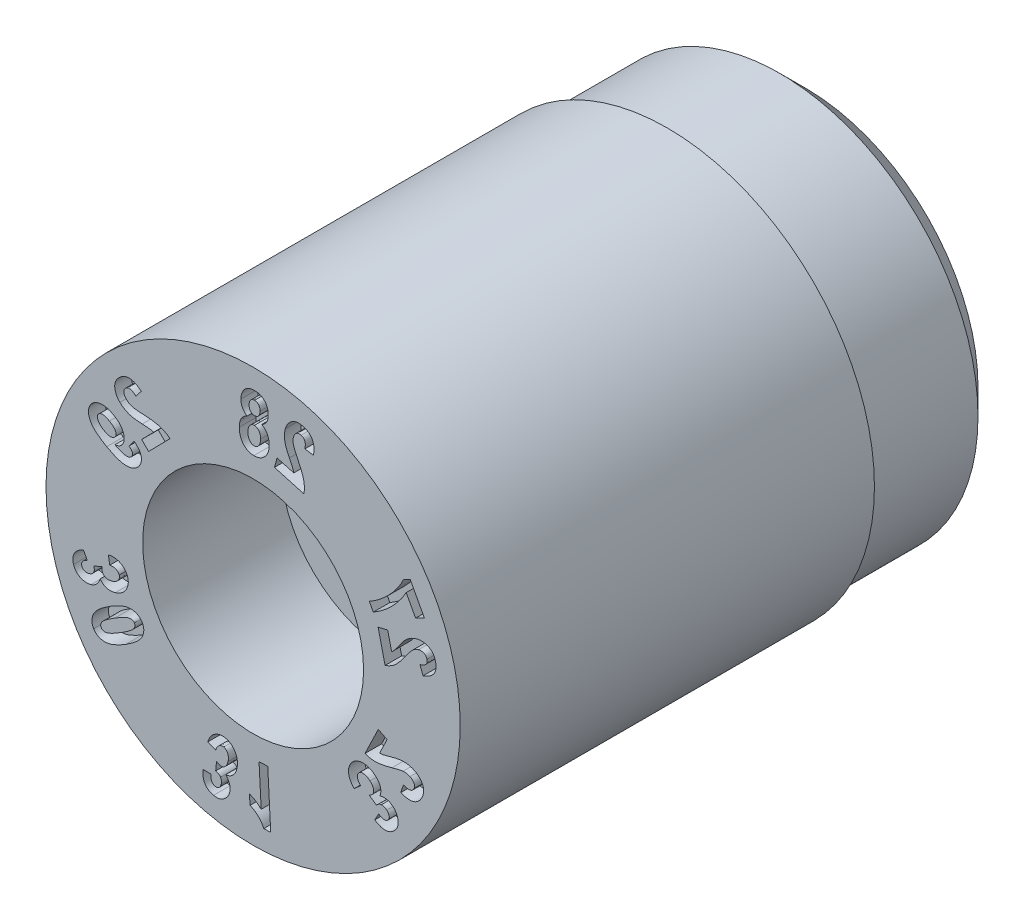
from build123d import *

# Parameters (mm, degrees)
SKETCH5_W          = 1
SKETCH5_H          = 1
CUT_EXTRUDE3_DEPTH = 0.12


with BuildPart() as part:
    # Sketch1 → Revolve1 (revolve)
    with BuildSketch(Plane(origin=(0, 0, 0), x_dir=(0, 0, -1), z_dir=(1, 0, 0)), mode=Mode.PRIVATE) as revolve1_sk:
        Polygon((0, 1.5), (0, 0.8), (1, 0.8), (1, 0.5), (4, 0.5), (4, 1.25), (3.75, 1.5), align=None)
    revolve(revolve1_sk.sketch.rotate(Axis((0, 0, 3.797909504), (0, 0, -1)), 90), axis=Axis((0, 0, 3.797909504), (0, 0, -1)))

    # Sketch5 → Cut-Revolve1 (revolve, cut)
    with BuildSketch(Plane(origin=(0, 0, 0), x_dir=(0, 0, -1), z_dir=(1, 0, 0)), mode=Mode.PRIVATE) as cut_revolve1_sk:
        with Locations((3.5, 1.935)):
            Rectangle(SKETCH5_W, SKETCH5_H)
    revolve(cut_revolve1_sk.sketch.rotate(Axis((0, 0, 0), (0, 0, -1)), 90), axis=Axis((0, 0, 0), (0, 0, -1)), mode=Mode.SUBTRACT)

    # Sketch12 → Cut-Extrude3 (cut)
    # profile 1 of 12: a face of its own
    with BuildSketch(Plane.XY):
        with BuildLine():
            Line((0.974609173, 0.338144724), (0.905148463, 0.321745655))
            Line((0.905148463, 0.321745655), (0.955971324, 0.10664616))
            add(Edge.make_bspline(
                [(0.955971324, 0.10664616), (0.962315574, 0.108938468), (0.9749237, 0.113494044), (0.992944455, 0.122459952), (1.010020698, 0.133080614), (1.023609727, 0.14335984), (1.034378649, 0.152803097), (1.042804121, 0.161254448), (1.051780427, 0.170814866), (1.061181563, 0.181607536), (1.071021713, 0.19360956), (1.081394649, 0.206736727), (1.092033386, 0.221178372), (1.09923475, 0.231232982), (1.102955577, 0.236428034)],
                knots=[0, 0, 0, 0, 1.213893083, 2.412407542, 3.616139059, 4.830628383, 5.475865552, 6.193816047, 6.978445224, 7.837046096, 8.770495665, 9.772985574, 10.849338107, 12, 12, 12, 12], degree=3))
            add(Edge.make_bspline(
                [(1.102955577, 0.236428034), (1.105862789, 0.240524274), (1.111410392, 0.248340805), (1.119537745, 0.259338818), (1.126882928, 0.269197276), (1.133503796, 0.277877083), (1.139508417, 0.28532577), (1.14481139, 0.291570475), (1.149295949, 0.296733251), (1.15224648, 0.299573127), (1.153560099, 0.300837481)],
                knots=[0, 0, 0, 0, 1.470113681, 2.80530214, 4.002305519, 5.068324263, 6.000261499, 6.801944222, 7.466608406, 8, 8, 8, 8], degree=3))
            add(Edge.make_bspline(
                [(1.153560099, 0.300837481), (1.156958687, 0.303909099), (1.16357661, 0.309890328), (1.174586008, 0.317015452), (1.185919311, 0.322676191), (1.193908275, 0.324906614), (1.19787527, 0.326014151)],
                knots=[0, 0, 0, 0, 1.064698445, 2.073241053, 3.043249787, 4, 4, 4, 4], degree=3))
            add(Edge.make_bspline(
                [(1.19787527, 0.326014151), (1.201924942, 0.326825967), (1.209539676, 0.328352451), (1.22062684, 0.328792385), (1.230511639, 0.327364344), (1.239163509, 0.324062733), (1.246461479, 0.319186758), (1.252373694, 0.312932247), (1.256840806, 0.305341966), (1.258458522, 0.299639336), (1.259296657, 0.296684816)],
                knots=[0, 0, 0, 0, 1.286861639, 2.41972907, 3.44296348, 4.380779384, 5.284129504, 6.157128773, 7.045212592, 8, 8, 8, 8], degree=3))
            add(Edge.make_bspline(
                [(1.259296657, 0.296684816), (1.259926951, 0.293416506), (1.261135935, 0.28714747), (1.260086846, 0.277767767), (1.257100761, 0.269079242), (1.251526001, 0.261321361), (1.243938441, 0.25429521), (1.23416358, 0.248073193), (1.222226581, 0.242691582), (1.213417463, 0.239872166), (1.208735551, 0.23837369)],
                knots=[0, 0, 0, 0, 0.918120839, 1.761073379, 2.583477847, 3.439679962, 4.379580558, 5.436722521, 6.637657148, 8, 8, 8, 8], degree=3))
            Line((1.208735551, 0.23837369), (1.230664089, 0.17910678))
            add(Edge.make_bspline(
                [(1.230664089, 0.17910678), (1.23535633, 0.180779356), (1.244438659, 0.184016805), (1.257329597, 0.189580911), (1.26899065, 0.195717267), (1.279676, 0.202077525), (1.289030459, 0.209190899), (1.297418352, 0.216531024), (1.304512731, 0.224475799), (1.310503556, 0.232841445), (1.315380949, 0.241631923), (1.319207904, 0.250799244), (1.322188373, 0.260255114), (1.323991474, 0.270141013), (1.324778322, 0.28036738), (1.324624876, 0.290957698), (1.323321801, 0.301884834), (1.321802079, 0.309205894), (1.321025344, 0.312947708)],
                knots=[0, 0, 0, 0, 1.321152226, 2.557229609, 3.720050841, 4.814888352, 5.850918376, 6.832839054, 7.767048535, 8.669200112, 9.557022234, 10.427296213, 11.300376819, 12.181677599, 13.086309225, 14.017204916, 14.986587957, 16, 16, 16, 16], degree=3))
            add(Edge.make_bspline(
                [(1.321025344, 0.312947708), (1.319970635, 0.317002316), (1.31792302, 0.324873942), (1.313647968, 0.335965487), (1.308582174, 0.346060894), (1.302583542, 0.35510977), (1.295861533, 0.363284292), (1.288120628, 0.370267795), (1.279630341, 0.37632434), (1.270354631, 0.381213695), (1.260658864, 0.385242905), (1.250746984, 0.388342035), (1.240775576, 0.390712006), (1.230644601, 0.392012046), (1.220429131, 0.3926537), (1.210056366, 0.392308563), (1.199609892, 0.391109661), (1.192688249, 0.38963744), (1.189200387, 0.388895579)],
                knots=[0, 0, 0, 0, 1.174391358, 2.279966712, 3.327326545, 4.336455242, 5.319446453, 6.287707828, 7.252005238, 8.237483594, 9.22202635, 10.193494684, 11.147734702, 12.092877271, 13.054932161, 14.015938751, 15.000218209, 16, 16, 16, 16], degree=3))
            add(Edge.make_bspline(
                [(1.189200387, 0.388895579), (1.185251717, 0.387862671), (1.177422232, 0.385814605), (1.165949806, 0.381834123), (1.154895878, 0.377010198), (1.144126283, 0.371496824), (1.133693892, 0.365071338), (1.123462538, 0.357809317), (1.113457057, 0.34956034), (1.105181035, 0.342093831), (1.098521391, 0.335394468), (1.093233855, 0.329675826), (1.087714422, 0.323283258), (1.081960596, 0.316220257), (1.075962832, 0.308480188), (1.069549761, 0.300174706), (1.063061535, 0.29106488), (1.058616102, 0.284795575), (1.056326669, 0.281566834)],
                knots=[0, 0, 0, 0, 1.117855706, 2.216501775, 3.322499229, 4.419593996, 5.528196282, 6.676118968, 7.853924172, 9.078742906, 9.728012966, 10.441119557, 11.211980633, 12.041344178, 12.936494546, 13.894495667, 14.915648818, 16, 16, 16, 16], degree=3))
            add(Edge.make_bspline(
                [(1.056326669, 0.281566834), (1.054253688, 0.278584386), (1.050294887, 0.272888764), (1.044453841, 0.264877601), (1.039345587, 0.257549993), (1.034662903, 0.251153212), (1.030498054, 0.245640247), (1.026938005, 0.240928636), (1.023894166, 0.237070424), (1.01931627, 0.231391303), (1.012798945, 0.224259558), (1.006489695, 0.218819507), (1.003470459, 0.216216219)],
                knots=[0, 0, 0, 0, 1.292399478, 2.468114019, 3.527722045, 4.470738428, 5.288803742, 5.986325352, 6.572030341, 7.037354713, 8.582251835, 10, 10, 10, 10], degree=3))
            Line((1.003470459, 0.216216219), (0.974609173, 0.338144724))
        make_face()
    # profile 2 of 12: a face of its own
    with BuildSketch(Plane.XY):
        with BuildLine():
            Line((1.17689468, 0.513689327), (1.239887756, 0.54761878))
            Line((1.239887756, 0.54761878), (1.137371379, 0.737560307))
            Line((1.137371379, 0.737560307), (1.08814289, 0.711011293))
            add(Edge.make_bspline(
                [(1.08814289, 0.711011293), (1.086768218, 0.707713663), (1.083923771, 0.700890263), (1.078871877, 0.690621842), (1.073126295, 0.679918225), (1.066585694, 0.668826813), (1.05941052, 0.657253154), (1.051454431, 0.645282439), (1.042741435, 0.632939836), (1.030248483, 0.615797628), (1.013395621, 0.594424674), (0.99127685, 0.569746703), (0.967673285, 0.545761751), (0.946655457, 0.526806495), (0.929362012, 0.512215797), (0.916448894, 0.501820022), (0.903700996, 0.491972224), (0.891046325, 0.482765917), (0.878508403, 0.474112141), (0.866079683, 0.46605945), (0.853733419, 0.458679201), (0.845491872, 0.454077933), (0.84142392, 0.451806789)],
                knots=[0, 0, 0, 0, 0.589677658, 1.220150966, 1.888204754, 2.594833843, 3.345437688, 4.136041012, 4.967263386, 5.839397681, 7.637713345, 9.457599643, 11.307662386, 13.190540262, 14.127475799, 15.04279392, 15.927070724, 16.786519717, 17.625922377, 18.441798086, 19.230885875, 20, 20, 20, 20], degree=3))
            Line((0.84142392, 0.451806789), (0.870325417, 0.398319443))
            add(Edge.make_bspline(
                [(0.870325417, 0.398319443), (0.876469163, 0.401933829), (0.888762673, 0.409166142), (0.906759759, 0.420822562), (0.924427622, 0.433078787), (0.941647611, 0.44611475), (0.958609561, 0.459623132), (0.975146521, 0.473871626), (0.991217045, 0.488878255), (1.00700643, 0.504336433), (1.022219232, 0.520330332), (1.036758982, 0.536631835), (1.050657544, 0.553148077), (1.063689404, 0.569991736), (1.076081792, 0.587083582), (1.087709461, 0.604418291), (1.098716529, 0.621974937), (1.105401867, 0.63397331), (1.108740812, 0.639965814)],
                knots=[0, 0, 0, 0, 0.995778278, 1.992531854, 2.994910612, 3.999304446, 5.009408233, 6.023993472, 7.048068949, 8.080890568, 9.110747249, 10.131293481, 11.132338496, 12.125897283, 13.105989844, 14.081317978, 15.04172768, 16, 16, 16, 16], degree=3))
            Line((1.108740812, 0.639965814), (1.17689468, 0.513689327))
        make_face()
    # profile 3 of 12: a face of its own
    with BuildSketch(Plane.XY):
        with BuildLine():
            Line((0.173768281, 1.017058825), (0.154622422, 0.948202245))
            Line((0.154622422, 0.948202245), (0.367811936, 0.88884957))
            add(Edge.make_bspline(
                [(0.367811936, 0.88884957), (0.368883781, 0.895508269), (0.37101474, 0.908746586), (0.371798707, 0.928879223), (0.370748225, 0.948960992), (0.368316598, 0.96584304), (0.365178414, 0.979807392), (0.361941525, 0.991315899), (0.357939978, 1.003824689), (0.352871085, 1.017221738), (0.347250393, 1.031680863), (0.340601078, 1.047056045), (0.333238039, 1.063439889), (0.327865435, 1.074613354), (0.325097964, 1.080368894)],
                knots=[0, 0, 0, 0, 1.212693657, 2.410984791, 3.616827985, 4.82739911, 5.474748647, 6.191100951, 6.977937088, 7.837118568, 8.768013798, 9.769192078, 10.850893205, 12, 12, 12, 12], degree=3))
            add(Edge.make_bspline(
                [(0.325097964, 1.080368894), (0.322926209, 1.084895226), (0.318780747, 1.093535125), (0.313014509, 1.10597394), (0.307851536, 1.117180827), (0.303484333, 1.127243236), (0.299803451, 1.13608867), (0.296844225, 1.143754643), (0.294535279, 1.150222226), (0.293423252, 1.15419519), (0.292927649, 1.15596584)],
                knots=[0, 0, 0, 0, 1.465003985, 2.796411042, 4.000874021, 5.065559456, 5.997255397, 6.796374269, 7.463574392, 8, 8, 8, 8], degree=3))
            add(Edge.make_bspline(
                [(0.292927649, 1.15596584), (0.291902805, 1.16041369), (0.289905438, 1.169082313), (0.288994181, 1.182144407), (0.28943679, 1.194806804), (0.291362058, 1.202883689), (0.292316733, 1.206888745)],
                knots=[0, 0, 0, 0, 1.06194817, 2.069680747, 3.042819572, 4, 4, 4, 4], degree=3))
            add(Edge.make_bspline(
                [(0.292316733, 1.206888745), (0.293542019, 1.210833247), (0.295855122, 1.218279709), (0.300949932, 1.228143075), (0.30690996, 1.236245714), (0.31408197, 1.242178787), (0.321905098, 1.246235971), (0.330233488, 1.248425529), (0.33902306, 1.248665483), (0.344794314, 1.2473582), (0.347768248, 1.246684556)],
                knots=[0, 0, 0, 0, 1.283667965, 2.423318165, 3.440010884, 4.393652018, 5.293669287, 6.163337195, 7.053565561, 8, 8, 8, 8], degree=3))
            add(Edge.make_bspline(
                [(0.347768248, 1.246684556), (0.350907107, 1.245635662), (0.356961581, 1.243612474), (0.364763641, 1.238273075), (0.370910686, 1.231398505), (0.375011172, 1.222763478), (0.377561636, 1.212736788), (0.378211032, 1.201169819), (0.37725964, 1.188111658), (0.375463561, 1.179026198), (0.374505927, 1.174182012)],
                knots=[0, 0, 0, 0, 0.913091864, 1.761241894, 2.586190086, 3.438700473, 4.382142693, 5.436437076, 6.633159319, 8, 8, 8, 8], degree=3))
            Line((0.374505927, 1.174182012), (0.436963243, 1.164690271))
            add(Edge.make_bspline(
                [(0.436963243, 1.164690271), (0.437790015, 1.169597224), (0.439397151, 1.179135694), (0.440611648, 1.193150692), (0.441059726, 1.206383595), (0.440415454, 1.218806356), (0.438886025, 1.230447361), (0.436456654, 1.241319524), (0.432885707, 1.251355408), (0.428471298, 1.260655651), (0.423157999, 1.269194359), (0.417029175, 1.277000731), (0.410066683, 1.284065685), (0.402338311, 1.290468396), (0.393725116, 1.296096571), (0.38438875, 1.301084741), (0.374215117, 1.305327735), (0.367048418, 1.307475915), (0.363369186, 1.308578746)],
                knots=[0, 0, 0, 0, 1.318223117, 2.562452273, 3.72484134, 4.824594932, 5.854809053, 6.83345442, 7.770804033, 8.671683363, 9.556729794, 10.430345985, 11.296396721, 12.18062953, 13.08478433, 14.018259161, 14.982616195, 16, 16, 16, 16], degree=3))
            add(Edge.make_bspline(
                [(0.363369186, 1.308578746), (0.359309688, 1.309603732), (0.351392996, 1.311602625), (0.339578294, 1.313206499), (0.328243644, 1.313733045), (0.317409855, 1.312784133), (0.307013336, 1.310855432), (0.297150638, 1.30746113), (0.287712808, 1.303006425), (0.278990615, 1.297132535), (0.270792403, 1.290593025), (0.263223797, 1.283462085), (0.256420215, 1.275762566), (0.250197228, 1.267635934), (0.244874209, 1.258882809), (0.24018784, 1.249674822), (0.236047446, 1.239994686), (0.234029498, 1.233191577), (0.233007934, 1.229747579)],
                knots=[0, 0, 0, 0, 1.172008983, 2.285611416, 3.333877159, 4.343568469, 5.325485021, 6.288141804, 7.257221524, 8.240307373, 9.22584423, 10.193025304, 11.148855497, 12.101344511, 13.056332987, 14.013724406, 14.994470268, 16, 16, 16, 16], degree=3))
            add(Edge.make_bspline(
                [(0.233007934, 1.229747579), (0.231999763, 1.22578199), (0.229994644, 1.217894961), (0.228021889, 1.205890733), (0.22679029, 1.193857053), (0.226570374, 1.181747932), (0.227029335, 1.169478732), (0.228593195, 1.157007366), (0.230823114, 1.14424117), (0.233431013, 1.133392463), (0.236141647, 1.124365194), (0.238607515, 1.116965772), (0.241605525, 1.109061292), (0.244919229, 1.100547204), (0.248765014, 1.091504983), (0.253073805, 1.081928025), (0.257842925, 1.0717971), (0.261199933, 1.064893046), (0.262935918, 1.061322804)],
                knots=[0, 0, 0, 0, 1.118833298, 2.225210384, 3.324285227, 4.424978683, 5.535506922, 6.679923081, 7.860063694, 9.079469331, 9.729176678, 10.438034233, 11.212479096, 12.041448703, 12.93711857, 13.899988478, 14.914036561, 16, 16, 16, 16], degree=3))
            add(Edge.make_bspline(
                [(0.262935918, 1.061322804), (0.264532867, 1.058051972), (0.267588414, 1.051793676), (0.271901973, 1.042867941), (0.275763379, 1.034823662), (0.27903444, 1.027613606), (0.281943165, 1.0213196), (0.284454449, 1.015946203), (0.286310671, 1.011404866), (0.288988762, 1.004641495), (0.292143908, 0.995494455), (0.293819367, 0.987301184), (0.294625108, 0.983360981)],
                knots=[0, 0, 0, 0, 1.293396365, 2.47473948, 3.522694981, 4.464010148, 5.28798175, 5.986655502, 6.571231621, 7.030809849, 8.572094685, 10, 10, 10, 10], degree=3))
            Line((0.294625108, 0.983360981), (0.173768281, 1.017058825))
        make_face()
    # profile 4 of 12: a face of its own
    with BuildSketch(Plane.XY):
        with BuildLine():
            add(Edge.make_bspline(
                [(0.062153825, 1.171284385), (0.065879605, 1.173344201), (0.073161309, 1.177369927), (0.082768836, 1.185094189), (0.091067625, 1.193790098), (0.097842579, 1.203695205), (0.103083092, 1.21474849), (0.106783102, 1.226865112), (0.109139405, 1.240028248), (0.109472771, 1.249156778), (0.109644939, 1.253871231)],
                knots=[0, 0, 0, 0, 1.012582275, 1.97900149, 2.923330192, 3.867218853, 4.824741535, 5.826122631, 6.877295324, 8, 8, 8, 8], degree=3))
            add(Edge.make_bspline(
                [(0.109644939, 1.253871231), (0.109610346, 1.257719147), (0.109542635, 1.265250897), (0.108247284, 1.276225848), (0.106350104, 1.286649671), (0.103502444, 1.296470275), (0.09969862, 1.305629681), (0.09519648, 1.314253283), (0.08974252, 1.322222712), (0.083533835, 1.329619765), (0.076616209, 1.336300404), (0.068973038, 1.342034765), (0.060826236, 1.346988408), (0.052057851, 1.351020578), (0.042715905, 1.354177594), (0.032760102, 1.356390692), (0.022249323, 1.357916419), (0.015020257, 1.358087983), (0.011336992, 1.358175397)],
                knots=[0, 0, 0, 0, 1.140077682, 2.231540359, 3.27140789, 4.278712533, 5.256158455, 6.207482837, 7.1577244, 8.113064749, 9.066584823, 10.001948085, 10.940230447, 11.888268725, 12.857318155, 13.857925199, 14.908596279, 16, 16, 16, 16], degree=3))
            add(Edge.make_bspline(
                [(0.011336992, 1.358175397), (0.007435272, 1.358109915), (-0.000152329, 1.357982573), (-0.011191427, 1.356695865), (-0.021518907, 1.354383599), (-0.031188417, 1.351260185), (-0.040085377, 1.347031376), (-0.048291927, 1.34191234), (-0.055793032, 1.335854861), (-0.06244998, 1.328836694), (-0.068357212, 1.321209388), (-0.073677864, 1.313176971), (-0.077967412, 1.304581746), (-0.081619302, 1.295660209), (-0.084568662, 1.286351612), (-0.086507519, 1.276576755), (-0.087864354, 1.266425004), (-0.088056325, 1.259500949), (-0.088153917, 1.255981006)],
                knots=[0, 0, 0, 0, 1.163868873, 2.263353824, 3.308972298, 4.317437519, 5.288636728, 6.240313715, 7.197453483, 8.157075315, 9.119376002, 10.073515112, 11.026663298, 11.980119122, 12.948226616, 13.934606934, 14.950027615, 16, 16, 16, 16], degree=3))
            add(Edge.make_bspline(
                [(-0.088153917, 1.255981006), (-0.0880354, 1.251261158), (-0.087804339, 1.24205936), (-0.085638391, 1.228730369), (-0.081925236, 1.216344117), (-0.076622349, 1.205033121), (-0.070027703, 1.194847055), (-0.062297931, 1.185853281), (-0.053429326, 1.178122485), (-0.046728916, 1.1741212), (-0.043364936, 1.172112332)],
                knots=[0, 0, 0, 0, 1.131661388, 2.206283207, 3.22854469, 4.224270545, 5.192799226, 6.130720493, 7.061517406, 8, 8, 8, 8], degree=3))
            add(Edge.make_bspline(
                [(-0.043364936, 1.172112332), (-0.047874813, 1.169777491), (-0.056682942, 1.165217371), (-0.068168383, 1.156064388), (-0.078079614, 1.145767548), (-0.086105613, 1.133919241), (-0.092447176, 1.120725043), (-0.096923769, 1.106098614), (-0.099719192, 1.090071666), (-0.100082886, 1.078902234), (-0.100271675, 1.07310431)],
                knots=[0, 0, 0, 0, 1.00452585, 1.961914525, 2.895620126, 3.828293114, 4.785741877, 5.786969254, 6.851241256, 8, 8, 8, 8], degree=3))
            add(Edge.make_bspline(
                [(-0.100271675, 1.07310431), (-0.100164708, 1.067058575), (-0.099956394, 1.055284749), (-0.097506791, 1.038160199), (-0.093262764, 1.02213419), (-0.087336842, 1.007260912), (-0.07987402, 0.99377483), (-0.070999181, 0.981832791), (-0.060818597, 0.971518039), (-0.049234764, 0.963040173), (-0.036655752, 0.956362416), (-0.023238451, 0.951488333), (-0.009043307, 0.948413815), (0.000719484, 0.948023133), (0.005681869, 0.947824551)],
                knots=[0, 0, 0, 0, 1.181492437, 2.300909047, 3.372810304, 4.416263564, 5.423548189, 6.378028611, 7.317076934, 8.246357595, 9.173874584, 10.092431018, 11.03039078, 12, 12, 12, 12], degree=3))
            add(Edge.make_bspline(
                [(0.005681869, 0.947824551), (0.009584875, 0.947877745), (0.017236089, 0.947982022), (0.028441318, 0.949472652), (0.039101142, 0.952017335), (0.049290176, 0.95551888), (0.058983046, 0.960090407), (0.068110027, 0.965794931), (0.076790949, 0.972413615), (0.084830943, 0.980096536), (0.092148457, 0.988627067), (0.098619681, 0.997946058), (0.104020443, 1.008046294), (0.108488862, 1.018830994), (0.112030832, 1.030294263), (0.114400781, 1.042508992), (0.116037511, 1.055424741), (0.116283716, 1.064300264), (0.116409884, 1.068848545)],
                knots=[0, 0, 0, 0, 1.015289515, 1.990311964, 2.934847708, 3.863818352, 4.78976777, 5.717696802, 6.660261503, 7.626367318, 8.606488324, 9.581129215, 10.573319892, 11.581575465, 12.61566801, 13.690260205, 14.816368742, 16, 16, 16, 16], degree=3))
            add(Edge.make_bspline(
                [(0.116409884, 1.068848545), (0.116323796, 1.074682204), (0.116156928, 1.085989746), (0.113401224, 1.102295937), (0.109309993, 1.117444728), (0.103073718, 1.13118589), (0.095283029, 1.143622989), (0.08578904, 1.154522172), (0.07477541, 1.163995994), (0.066396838, 1.168834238), (0.062153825, 1.171284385)],
                knots=[0, 0, 0, 0, 1.143176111, 2.215849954, 3.235381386, 4.213893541, 5.165108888, 6.105057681, 7.040377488, 8, 8, 8, 8], degree=3))
        make_face()
        with BuildLine():
            add(Edge.make_bspline(
                [(0.049906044, 1.2489088), (0.04973786, 1.245196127), (0.049419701, 1.238172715), (0.047385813, 1.228286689), (0.043816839, 1.219781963), (0.038917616, 1.212682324), (0.032820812, 1.207203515), (0.025970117, 1.203220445), (0.01835813, 1.200789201), (0.013032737, 1.200519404), (0.010305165, 1.200381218)],
                knots=[0, 0, 0, 0, 1.26530026, 2.393618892, 3.41920316, 4.388406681, 5.30824362, 6.188988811, 7.072432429, 8, 8, 8, 8], degree=3))
            add(Edge.make_bspline(
                [(0.010305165, 1.200381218), (0.007556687, 1.200542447), (0.002167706, 1.200858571), (-0.005483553, 1.20342317), (-0.012322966, 1.207534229), (-0.018337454, 1.213130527), (-0.023197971, 1.220298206), (-0.026763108, 1.228835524), (-0.028669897, 1.238772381), (-0.028879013, 1.245787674), (-0.028989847, 1.249505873)],
                knots=[0, 0, 0, 0, 0.930776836, 1.824987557, 2.705094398, 3.621410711, 4.589244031, 5.621000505, 6.739098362, 8, 8, 8, 8], degree=3))
            add(Edge.make_bspline(
                [(-0.028989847, 1.249505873), (-0.028819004, 1.253082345), (-0.028493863, 1.259888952), (-0.026492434, 1.269529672), (-0.022798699, 1.277829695), (-0.01791409, 1.284820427), (-0.011926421, 1.29032179), (-0.005170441, 1.29427483), (0.002317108, 1.296768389), (0.00756983, 1.296963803), (0.010272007, 1.297064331)],
                knots=[0, 0, 0, 0, 1.240442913, 2.360764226, 3.390439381, 4.368715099, 5.297674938, 6.185667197, 7.066646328, 8, 8, 8, 8], degree=3))
            add(Edge.make_bspline(
                [(0.010272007, 1.297064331), (0.013071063, 1.296894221), (0.018525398, 1.296562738), (0.02633949, 1.294136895), (0.03322317, 1.289892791), (0.039268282, 1.284268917), (0.044157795, 1.277202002), (0.047651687, 1.268838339), (0.04956968, 1.25923993), (0.049790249, 1.25246533), (0.049906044, 1.2489088)],
                knots=[0, 0, 0, 0, 0.95723468, 1.865300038, 2.76563946, 3.70292155, 4.671550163, 5.68303407, 6.783638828, 8, 8, 8, 8], degree=3))
        make_face(mode=Mode.SUBTRACT)
        with BuildLine():
            add(Edge.make_bspline(
                [(0.054344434, 1.076746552), (0.054292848, 1.07412063), (0.054192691, 1.069022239), (0.053367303, 1.06164241), (0.052349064, 1.054701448), (0.050811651, 1.048222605), (0.04873875, 1.042253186), (0.04640928, 1.036681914), (0.043569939, 1.031613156), (0.039342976, 1.025642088), (0.033423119, 1.019337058), (0.025307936, 1.013804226), (0.016485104, 1.010220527), (0.010287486, 1.009901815), (0.007164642, 1.009741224)],
                knots=[0, 0, 0, 0, 1.035711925, 2.010899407, 2.927287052, 3.802651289, 4.633122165, 5.418164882, 6.182391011, 6.919673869, 8.302057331, 9.56664869, 10.773887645, 12, 12, 12, 12], degree=3))
            add(Edge.make_bspline(
                [(0.007164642, 1.009741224), (0.004083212, 1.009956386), (-0.002026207, 1.010382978), (-0.010686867, 1.013763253), (-0.018489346, 1.019218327), (-0.024063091, 1.025340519), (-0.028058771, 1.031138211), (-0.030657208, 1.036175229), (-0.032828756, 1.041737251), (-0.034599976, 1.04779588), (-0.035964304, 1.054357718), (-0.036888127, 1.061426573), (-0.037437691, 1.069024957), (-0.037455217, 1.074258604), (-0.037464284, 1.076966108)],
                knots=[0, 0, 0, 0, 1.225496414, 2.429739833, 3.650100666, 4.992582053, 5.704683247, 6.452630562, 7.24571022, 8.08141902, 8.965744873, 9.914409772, 10.921068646, 12, 12, 12, 12], degree=3))
            add(Edge.make_bspline(
                [(-0.037464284, 1.076966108), (-0.037281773, 1.081519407), (-0.03693459, 1.090180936), (-0.034433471, 1.102460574), (-0.030109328, 1.113210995), (-0.024211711, 1.12233941), (-0.017150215, 1.129675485), (-0.00918645, 1.135045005), (-0.000333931, 1.138254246), (0.005846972, 1.138607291), (0.008989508, 1.138786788)],
                knots=[0, 0, 0, 0, 1.267061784, 2.410272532, 3.468993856, 4.474068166, 5.417037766, 6.283948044, 7.12751363, 8, 8, 8, 8], degree=3))
            add(Edge.make_bspline(
                [(0.008989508, 1.138786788), (0.012097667, 1.138572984), (0.018233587, 1.138150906), (0.027002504, 1.134747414), (0.034821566, 1.129155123), (0.041775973, 1.121706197), (0.047471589, 1.112500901), (0.051526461, 1.101777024), (0.053979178, 1.08970276), (0.054218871, 1.08120047), (0.054344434, 1.076746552)],
                knots=[0, 0, 0, 0, 0.87043335, 1.718350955, 2.598697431, 3.549211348, 4.560249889, 5.616391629, 6.751348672, 8, 8, 8, 8], degree=3))
        make_face(mode=Mode.SUBTRACT)
    # profile 5 of 12: a face of its own
    with BuildSketch(Plane.XY):
        with BuildLine():
            Line((-0.807348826, 0.642346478), (-0.756347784, 0.592455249))
            Line((-0.756347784, 0.592455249), (-0.60190784, 0.750350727))
            add(Edge.make_bspline(
                [(-0.60190784, 0.750350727), (-0.607222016, 0.754483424), (-0.617812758, 0.76271957), (-0.635023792, 0.773121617), (-0.653117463, 0.781859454), (-0.669024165, 0.787920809), (-0.682759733, 0.791944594), (-0.694392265, 0.794531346), (-0.707230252, 0.797088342), (-0.721383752, 0.799112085), (-0.736764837, 0.801089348), (-0.753398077, 0.802735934), (-0.771292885, 0.804144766), (-0.783662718, 0.804823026), (-0.790059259, 0.80517376)],
                knots=[0, 0, 0, 0, 1.21200846, 2.415439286, 3.614439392, 4.828259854, 5.477291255, 6.191357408, 6.974382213, 7.835046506, 8.766368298, 9.768190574, 10.845913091, 12, 12, 12, 12], degree=3))
            add(Edge.make_bspline(
                [(-0.790059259, 0.80517376), (-0.795072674, 0.805427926), (-0.804616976, 0.805911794), (-0.818245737, 0.806869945), (-0.830500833, 0.807803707), (-0.841375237, 0.808783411), (-0.85087903, 0.80976501), (-0.858967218, 0.81088723), (-0.86571697, 0.812002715), (-0.8697118, 0.812919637), (-0.871503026, 0.813330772)],
                knots=[0, 0, 0, 0, 1.470297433, 2.799082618, 4.001631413, 5.070199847, 5.997141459, 6.799710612, 7.461806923, 8, 8, 8, 8], degree=3))
            add(Edge.make_bspline(
                [(-0.871503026, 0.813330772), (-0.875902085, 0.814587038), (-0.884460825, 0.817031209), (-0.896381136, 0.822487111), (-0.907189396, 0.829118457), (-0.913364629, 0.83468837), (-0.916430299, 0.837453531)],
                knots=[0, 0, 0, 0, 1.063164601, 2.068476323, 3.041102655, 4, 4, 4, 4], degree=3))
            add(Edge.make_bspline(
                [(-0.916430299, 0.837453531), (-0.919294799, 0.840427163), (-0.924687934, 0.846025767), (-0.930954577, 0.855182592), (-0.935065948, 0.864306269), (-0.936829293, 0.873381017), (-0.936647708, 0.882125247), (-0.934491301, 0.890424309), (-0.93039462, 0.898183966), (-0.926479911, 0.902616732), (-0.924454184, 0.904910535)],
                knots=[0, 0, 0, 0, 1.287915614, 2.424822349, 3.448060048, 4.391438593, 5.288243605, 6.157714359, 7.046680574, 8, 8, 8, 8], degree=3))
            add(Edge.make_bspline(
                [(-0.924454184, 0.904910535), (-0.922021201, 0.907144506), (-0.917343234, 0.911439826), (-0.908954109, 0.91574938), (-0.89995645, 0.917699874), (-0.890433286, 0.917216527), (-0.880477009, 0.914521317), (-0.87004084, 0.909609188), (-0.859044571, 0.902538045), (-0.851974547, 0.89656833), (-0.848215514, 0.893394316)],
                knots=[0, 0, 0, 0, 0.914228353, 1.757813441, 2.58459647, 3.442880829, 4.380136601, 5.43210805, 6.634687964, 8, 8, 8, 8], degree=3))
            Line((-0.848215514, 0.893394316), (-0.809914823, 0.943497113))
            add(Edge.make_bspline(
                [(-0.809914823, 0.943497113), (-0.813807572, 0.94658197), (-0.821355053, 0.952563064), (-0.833052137, 0.960344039), (-0.844431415, 0.967016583), (-0.855567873, 0.97253308), (-0.866475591, 0.976840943), (-0.87722642, 0.979754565), (-0.887696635, 0.981633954), (-0.897956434, 0.982228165), (-0.90796003, 0.981674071), (-0.917768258, 0.980106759), (-0.927294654, 0.977329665), (-0.93663562, 0.973622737), (-0.94573029, 0.968857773), (-0.954562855, 0.96302006), (-0.963162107, 0.956142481), (-0.968513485, 0.950913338), (-0.97125491, 0.948234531)],
                knots=[0, 0, 0, 0, 1.317438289, 2.554323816, 3.724045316, 4.815796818, 5.849069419, 6.830353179, 7.766668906, 8.666950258, 9.550472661, 10.420592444, 11.296498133, 12.17794712, 13.083366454, 14.01559971, 14.983423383, 16, 16, 16, 16], degree=3))
            add(Edge.make_bspline(
                [(-0.97125491, 0.948234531), (-0.97408709, 0.945193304), (-0.979613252, 0.939259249), (-0.986733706, 0.929770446), (-0.992513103, 0.920052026), (-0.997054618, 0.9102349), (-1.000245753, 0.900184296), (-1.002013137, 0.889960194), (-1.002677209, 0.879560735), (-1.001788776, 0.869092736), (-0.99990647, 0.858784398), (-0.997387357, 0.848680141), (-0.993885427, 0.839031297), (-0.989706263, 0.829709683), (-0.984694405, 0.82077767), (-0.978903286, 0.812203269), (-0.972287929, 0.804004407), (-0.967337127, 0.798949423), (-0.964829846, 0.79638938)],
                knots=[0, 0, 0, 0, 1.166159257, 2.275415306, 3.322953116, 4.335366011, 5.305817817, 6.274126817, 7.241809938, 8.223140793, 9.214736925, 10.182062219, 11.142893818, 12.092429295, 13.047297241, 14.014413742, 14.994420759, 16, 16, 16, 16], degree=3))
            add(Edge.make_bspline(
                [(-0.964829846, 0.79638938), (-0.961862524, 0.793592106), (-0.955984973, 0.78805138), (-0.946451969, 0.780588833), (-0.936511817, 0.773836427), (-0.926077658, 0.767755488), (-0.915095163, 0.762384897), (-0.903514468, 0.75756531), (-0.891237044, 0.753462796), (-0.880466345, 0.750620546), (-0.87128647, 0.748514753), (-0.863606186, 0.747180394), (-0.855240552, 0.745907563), (-0.846206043, 0.744710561), (-0.836465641, 0.74369799), (-0.826020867, 0.742907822), (-0.814882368, 0.742161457), (-0.807237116, 0.74176627), (-0.803307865, 0.741563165)],
                knots=[0, 0, 0, 0, 1.118439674, 2.215360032, 3.317418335, 4.413660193, 5.525997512, 6.669485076, 7.85302234, 9.074688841, 9.724687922, 10.436641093, 11.212884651, 12.046538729, 12.936965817, 13.899491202, 14.920450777, 16, 16, 16, 16], degree=3))
            add(Edge.make_bspline(
                [(-0.803307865, 0.741563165), (-0.799677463, 0.741368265), (-0.792741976, 0.74099593), (-0.782822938, 0.74049779), (-0.773906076, 0.739975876), (-0.765996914, 0.739377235), (-0.759105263, 0.738926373), (-0.753227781, 0.738362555), (-0.748338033, 0.737942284), (-0.741114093, 0.73702706), (-0.731591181, 0.735405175), (-0.723620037, 0.732985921), (-0.719800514, 0.731826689)],
                knots=[0, 0, 0, 0, 1.293461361, 2.471015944, 3.533406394, 4.471132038, 5.292951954, 5.990283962, 6.571757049, 7.038689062, 8.581032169, 10, 10, 10, 10], degree=3))
            Line((-0.719800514, 0.731826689), (-0.807348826, 0.642346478))
        make_face()
    # profile 6 of 12: a face of its own
    with BuildSketch(Plane.XY):
        with BuildLine():
            Line((-0.862318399, 0.604288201), (-0.899228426, 0.555174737))
            add(Edge.make_bspline(
                [(-0.899228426, 0.555174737), (-0.896376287, 0.553118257), (-0.890982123, 0.549228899), (-0.884208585, 0.542677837), (-0.878899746, 0.536159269), (-0.875317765, 0.529478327), (-0.873380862, 0.522694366), (-0.873042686, 0.515849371), (-0.874561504, 0.508951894), (-0.87665643, 0.504680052), (-0.877746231, 0.5024578)],
                knots=[0, 0, 0, 0, 1.328957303, 2.513416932, 3.554718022, 4.498606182, 5.360659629, 6.203905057, 7.065654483, 8, 8, 8, 8], degree=3))
            add(Edge.make_bspline(
                [(-0.877746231, 0.5024578), (-0.878642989, 0.501004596), (-0.880421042, 0.498123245), (-0.883707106, 0.494245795), (-0.887613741, 0.49106436), (-0.891893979, 0.48826577), (-0.896754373, 0.486246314), (-0.902034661, 0.484591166), (-0.907848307, 0.483712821), (-0.914216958, 0.483124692), (-0.921434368, 0.483435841), (-0.929596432, 0.484784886), (-0.938881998, 0.486942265), (-0.949203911, 0.490217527), (-0.960666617, 0.494317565), (-0.973227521, 0.499415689), (-0.986831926, 0.505556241), (-0.996236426, 0.510034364), (-1.001141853, 0.512370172)],
                knots=[0, 0, 0, 0, 0.60413011, 1.197843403, 1.788457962, 2.382403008, 3.001459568, 3.645004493, 4.336915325, 5.077997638, 5.906857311, 6.885554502, 8.003125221, 9.279046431, 10.716621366, 12.312443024, 14.076554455, 16, 16, 16, 16], degree=3))
            add(Edge.make_bspline(
                [(-1.001141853, 0.512370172), (-0.997885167, 0.512816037), (-0.991533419, 0.513685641), (-0.982382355, 0.5158716), (-0.97400765, 0.519149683), (-0.966275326, 0.523085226), (-0.959201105, 0.527823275), (-0.953036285, 0.53363893), (-0.947415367, 0.540156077), (-0.94440786, 0.545114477), (-0.942880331, 0.547632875)],
                knots=[0, 0, 0, 0, 1.111643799, 2.168118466, 3.173361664, 4.146253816, 5.099181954, 6.041503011, 7.005269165, 8, 8, 8, 8], degree=3))
            add(Edge.make_bspline(
                [(-0.942880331, 0.547632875), (-0.941452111, 0.550363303), (-0.938615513, 0.555786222), (-0.935733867, 0.564523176), (-0.934034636, 0.573539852), (-0.933264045, 0.582874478), (-0.933686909, 0.592503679), (-0.935292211, 0.602435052), (-0.937968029, 0.612660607), (-0.941654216, 0.623128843), (-0.946387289, 0.633578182), (-0.952431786, 0.643585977), (-0.959354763, 0.653282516), (-0.967530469, 0.662389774), (-0.976622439, 0.67120263), (-0.986926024, 0.679456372), (-0.998235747, 0.687406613), (-1.006380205, 0.692149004), (-1.010544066, 0.694573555)],
                knots=[0, 0, 0, 0, 0.823975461, 1.636502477, 2.451769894, 3.276254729, 4.138906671, 5.025499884, 5.965029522, 6.965322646, 7.994168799, 9.030207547, 10.090875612, 11.179453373, 12.30222914, 13.477618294, 14.710430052, 16, 16, 16, 16], degree=3))
            add(Edge.make_bspline(
                [(-1.010544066, 0.694573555), (-1.015077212, 0.697013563), (-1.023908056, 0.701766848), (-1.037391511, 0.70760787), (-1.050533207, 0.712407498), (-1.063494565, 0.715681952), (-1.076108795, 0.717957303), (-1.088494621, 0.718888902), (-1.100598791, 0.718657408), (-1.112330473, 0.717028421), (-1.123535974, 0.714491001), (-1.13402581, 0.710795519), (-1.143798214, 0.706295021), (-1.152790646, 0.700787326), (-1.160957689, 0.694320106), (-1.168420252, 0.686975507), (-1.175034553, 0.678609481), (-1.178769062, 0.672464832), (-1.18066194, 0.669350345)],
                knots=[0, 0, 0, 0, 1.283663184, 2.500654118, 3.662240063, 4.769619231, 5.831213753, 6.855907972, 7.863024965, 8.845042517, 9.805484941, 10.724233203, 11.614168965, 12.484828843, 13.347948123, 14.207444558, 15.091422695, 16, 16, 16, 16], degree=3))
            add(Edge.make_bspline(
                [(-1.18066194, 0.669350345), (-1.182515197, 0.665741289), (-1.186169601, 0.658624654), (-1.18998465, 0.647324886), (-1.192231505, 0.635771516), (-1.192841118, 0.623968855), (-1.191862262, 0.611963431), (-1.18945339, 0.599715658), (-1.185349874, 0.587290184), (-1.179902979, 0.574519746), (-1.172444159, 0.56164283), (-1.162811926, 0.548762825), (-1.151073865, 0.535794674), (-1.137126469, 0.522810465), (-1.120962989, 0.509837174), (-1.102681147, 0.49676533), (-1.082300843, 0.483520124), (-1.067703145, 0.475175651), (-1.060135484, 0.470849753)],
                knots=[0, 0, 0, 0, 0.750424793, 1.479749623, 2.199583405, 2.923589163, 3.660735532, 4.424766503, 5.229155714, 6.079355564, 6.991492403, 7.9771097, 9.052093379, 10.22615271, 11.501698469, 12.887119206, 14.38623697, 16, 16, 16, 16], degree=3))
            add(Edge.make_bspline(
                [(-1.060135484, 0.470849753), (-1.05233795, 0.466605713), (-1.037302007, 0.458421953), (-1.01501993, 0.447656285), (-0.993867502, 0.438873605), (-0.973970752, 0.431731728), (-0.955146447, 0.426623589), (-0.937503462, 0.423224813), (-0.920973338, 0.421820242), (-0.90559845, 0.422305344), (-0.891357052, 0.424327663), (-0.878163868, 0.427722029), (-0.865910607, 0.432250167), (-0.854763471, 0.438293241), (-0.844505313, 0.44544688), (-0.835450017, 0.454098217), (-0.827165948, 0.463837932), (-0.822763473, 0.471236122), (-0.820525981, 0.474996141)],
                knots=[0, 0, 0, 0, 1.587718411, 3.061588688, 4.423547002, 5.682677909, 6.839770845, 7.908792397, 8.892193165, 9.800345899, 10.654357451, 11.459504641, 12.233010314, 12.984354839, 13.721508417, 14.462732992, 15.218707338, 16, 16, 16, 16], degree=3))
            add(Edge.make_bspline(
                [(-0.820525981, 0.474996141), (-0.819128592, 0.47768064), (-0.816381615, 0.482957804), (-0.813036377, 0.491078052), (-0.810691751, 0.499276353), (-0.809081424, 0.507462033), (-0.808522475, 0.51572331), (-0.808711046, 0.523978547), (-0.809766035, 0.532263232), (-0.811688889, 0.540550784), (-0.814563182, 0.548807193), (-0.818443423, 0.556993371), (-0.82336842, 0.565062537), (-0.82914163, 0.573159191), (-0.836082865, 0.581040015), (-0.843898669, 0.588922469), (-0.85260672, 0.59685598), (-0.859020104, 0.601764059), (-0.862318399, 0.604288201)],
                knots=[0, 0, 0, 0, 0.964153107, 1.895323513, 2.792506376, 3.677510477, 4.548460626, 5.425364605, 6.305145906, 7.204852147, 8.131581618, 9.085581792, 10.085722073, 11.140412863, 12.250221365, 13.427627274, 14.677072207, 16, 16, 16, 16], degree=3))
        make_face()
        with BuildLine():
            add(Edge.make_bspline(
                [(-1.078345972, 0.56185372), (-1.08100704, 0.563371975), (-1.086172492, 0.56631909), (-1.093296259, 0.571237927), (-1.099883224, 0.576031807), (-1.105626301, 0.581140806), (-1.110838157, 0.586216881), (-1.115235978, 0.591563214), (-1.118986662, 0.596979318), (-1.121948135, 0.602518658), (-1.124392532, 0.607920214), (-1.126039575, 0.613243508), (-1.127357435, 0.618284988), (-1.127772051, 0.623191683), (-1.127883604, 0.62787781), (-1.127114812, 0.632359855), (-1.125837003, 0.63665167), (-1.124483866, 0.639293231), (-1.123805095, 0.640618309)],
                knots=[0, 0, 0, 0, 1.466778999, 2.847192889, 4.144364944, 5.365915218, 6.525822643, 7.625520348, 8.676564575, 9.675834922, 10.630754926, 11.510894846, 12.342866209, 13.119605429, 13.864217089, 14.581132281, 15.288257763, 16, 16, 16, 16], degree=3))
            add(Edge.make_bspline(
                [(-1.123805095, 0.640618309), (-1.122265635, 0.64298276), (-1.119215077, 0.6476681), (-1.112375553, 0.652878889), (-1.104246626, 0.656452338), (-1.09649889, 0.657921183), (-1.089654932, 0.65813844), (-1.083914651, 0.657627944), (-1.077764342, 0.656407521), (-1.0712191, 0.65458628), (-1.064236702, 0.652128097), (-1.056843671, 0.648971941), (-1.048998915, 0.645209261), (-1.043730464, 0.642333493), (-1.041005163, 0.640845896)],
                knots=[0, 0, 0, 0, 1.093329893, 2.166515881, 3.294676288, 4.533330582, 5.213874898, 5.960940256, 6.77504013, 7.655939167, 8.608432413, 9.659607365, 10.789345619, 12, 12, 12, 12], degree=3))
            add(Edge.make_bspline(
                [(-1.041005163, 0.640845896), (-1.038302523, 0.639281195), (-1.033085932, 0.636261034), (-1.025747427, 0.631493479), (-1.019186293, 0.626675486), (-1.013299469, 0.621891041), (-1.008315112, 0.616926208), (-1.003918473, 0.612101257), (-1.000394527, 0.607134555), (-0.996808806, 0.600676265), (-0.993797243, 0.592684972), (-0.992388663, 0.583178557), (-0.993358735, 0.573999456), (-0.995904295, 0.568567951), (-0.997183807, 0.565837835)],
                knots=[0, 0, 0, 0, 1.163058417, 2.244915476, 3.257332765, 4.194262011, 5.066817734, 5.875338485, 6.622767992, 7.328835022, 8.623342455, 9.778559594, 10.883405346, 12, 12, 12, 12], degree=3))
            add(Edge.make_bspline(
                [(-0.997183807, 0.565837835), (-0.998749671, 0.563416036), (-1.00187895, 0.558576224), (-1.008993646, 0.553260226), (-1.017454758, 0.549483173), (-1.0255313, 0.54783923), (-1.032589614, 0.547274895), (-1.038354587, 0.547545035), (-1.044362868, 0.548445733), (-1.05069262, 0.549795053), (-1.057215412, 0.551957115), (-1.064047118, 0.554677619), (-1.07117287, 0.557949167), (-1.075916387, 0.560531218), (-1.078345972, 0.56185372)],
                knots=[0, 0, 0, 0, 1.141977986, 2.282170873, 3.478506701, 4.816050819, 5.544671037, 6.298726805, 7.110970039, 7.965531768, 8.875951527, 9.846939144, 10.897222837, 12, 12, 12, 12], degree=3))
        make_face(mode=Mode.SUBTRACT)
    # profile 7 of 12: a face of its own
    with BuildSketch(Plane.XY):
        with BuildLine():
            Line((-1.047704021, -0.200939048), (-1.038812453, -0.26183867))
            add(Edge.make_bspline(
                [(-1.038812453, -0.26183867), (-1.034397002, -0.261053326), (-1.02600031, -0.259559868), (-1.013776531, -0.259334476), (-1.00270703, -0.260650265), (-0.992955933, -0.263937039), (-0.984665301, -0.268625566), (-0.977725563, -0.274346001), (-0.972604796, -0.281447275), (-0.970589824, -0.28680148), (-0.969579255, -0.289486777)],
                knots=[0, 0, 0, 0, 1.309394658, 2.490024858, 3.560846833, 4.552956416, 5.476300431, 6.332519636, 7.163708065, 8, 8, 8, 8], degree=3))
            add(Edge.make_bspline(
                [(-0.969579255, -0.289486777), (-0.96886037, -0.292548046), (-0.967437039, -0.298609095), (-0.968357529, -0.308089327), (-0.971535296, -0.317378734), (-0.976142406, -0.324659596), (-0.980683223, -0.330385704), (-0.984809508, -0.334472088), (-0.989497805, -0.338177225), (-0.994541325, -0.341821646), (-1.000297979, -0.344905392), (-1.006439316, -0.34797858), (-1.013185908, -0.350660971), (-1.017916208, -0.352145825), (-1.020352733, -0.352910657)],
                knots=[0, 0, 0, 0, 1.244890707, 2.464776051, 3.731891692, 5.124722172, 5.870901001, 6.639983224, 7.430058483, 8.2491303, 9.11343342, 10.026136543, 10.983284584, 12, 12, 12, 12], degree=3))
            add(Edge.make_bspline(
                [(-1.020352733, -0.352910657), (-1.024817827, -0.354096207), (-1.033312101, -0.356351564), (-1.045901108, -0.357628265), (-1.057502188, -0.356940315), (-1.067860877, -0.354082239), (-1.076871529, -0.349860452), (-1.084112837, -0.344055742), (-1.089740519, -0.337045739), (-1.091786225, -0.331536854), (-1.092815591, -0.328764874)],
                knots=[0, 0, 0, 0, 1.303447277, 2.479643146, 3.558966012, 4.566335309, 5.498364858, 6.349227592, 7.169358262, 8, 8, 8, 8], degree=3))
            add(Edge.make_bspline(
                [(-1.092815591, -0.328764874), (-1.093339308, -0.326723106), (-1.094437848, -0.32244033), (-1.095296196, -0.315505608), (-1.095837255, -0.307843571), (-1.095703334, -0.30247809), (-1.09563326, -0.299670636)],
                knots=[0, 0, 0, 0, 0.861209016, 1.806457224, 2.852242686, 4, 4, 4, 4], degree=3))
            Line((-1.09563326, -0.299670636), (-1.153495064, -0.324172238))
            add(Edge.make_bspline(
                [(-1.153495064, -0.324172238), (-1.152450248, -0.32786299), (-1.15044216, -0.334956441), (-1.149786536, -0.345654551), (-1.151058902, -0.355747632), (-1.153656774, -0.361772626), (-1.154943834, -0.364757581)],
                knots=[0, 0, 0, 0, 1.102065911, 2.118118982, 3.067662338, 4, 4, 4, 4], degree=3))
            add(Edge.make_bspline(
                [(-1.154943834, -0.364757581), (-1.156655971, -0.36752565), (-1.160107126, -0.373105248), (-1.167697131, -0.379955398), (-1.177006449, -0.385533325), (-1.184121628, -0.387925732), (-1.187839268, -0.389175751)],
                knots=[0, 0, 0, 0, 0.924630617, 1.863777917, 2.883836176, 4, 4, 4, 4], degree=3))
            add(Edge.make_bspline(
                [(-1.187839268, -0.389175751), (-1.191016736, -0.390049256), (-1.19705218, -0.391708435), (-1.206061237, -0.392263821), (-1.214360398, -0.391535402), (-1.221850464, -0.389112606), (-1.228380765, -0.385407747), (-1.233727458, -0.380463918), (-1.237988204, -0.37444992), (-1.239659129, -0.369803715), (-1.24052089, -0.367407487)],
                knots=[0, 0, 0, 0, 1.232298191, 2.340689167, 3.364091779, 4.338309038, 5.268220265, 6.156310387, 7.04913764, 8, 8, 8, 8], degree=3))
            add(Edge.make_bspline(
                [(-1.24052089, -0.367407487), (-1.241118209, -0.364906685), (-1.242306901, -0.359929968), (-1.241732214, -0.35214288), (-1.239548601, -0.344446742), (-1.235632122, -0.336833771), (-1.229736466, -0.329675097), (-1.221962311, -0.323117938), (-1.212309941, -0.317295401), (-1.205040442, -0.314187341), (-1.201209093, -0.312549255)],
                knots=[0, 0, 0, 0, 0.824783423, 1.64135938, 2.482588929, 3.392657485, 4.38044552, 5.45279812, 6.657511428, 8, 8, 8, 8], degree=3))
            Line((-1.201209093, -0.312549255), (-1.229374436, -0.260327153))
            add(Edge.make_bspline(
                [(-1.229374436, -0.260327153), (-1.233372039, -0.262368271), (-1.241134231, -0.266331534), (-1.252081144, -0.272774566), (-1.261956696, -0.279515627), (-1.27085779, -0.286426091), (-1.278677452, -0.293617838), (-1.285416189, -0.301114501), (-1.291102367, -0.308842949), (-1.295751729, -0.316838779), (-1.299404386, -0.325033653), (-1.302190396, -0.333417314), (-1.30400026, -0.341994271), (-1.305133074, -0.350741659), (-1.305176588, -0.359696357), (-1.304519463, -0.368810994), (-1.303012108, -0.378123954), (-1.301280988, -0.384261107), (-1.300395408, -0.387400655)],
                knots=[0, 0, 0, 0, 1.337744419, 2.597514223, 3.783156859, 4.899636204, 5.953696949, 6.945443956, 7.899758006, 8.808656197, 9.696888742, 10.569757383, 11.436644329, 12.306153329, 13.19420279, 14.100521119, 15.028294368, 16, 16, 16, 16], degree=3))
            add(Edge.make_bspline(
                [(-1.300395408, -0.387400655), (-1.299269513, -0.3908533), (-1.297057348, -0.39763707), (-1.292586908, -0.407127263), (-1.287339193, -0.415785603), (-1.28142163, -0.423679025), (-1.274490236, -0.43059707), (-1.266934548, -0.43677586), (-1.258549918, -0.442119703), (-1.249452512, -0.44642967), (-1.240019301, -0.450035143), (-1.230496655, -0.452834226), (-1.220961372, -0.454601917), (-1.211499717, -0.455680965), (-1.202073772, -0.455886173), (-1.192692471, -0.45525775), (-1.183316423, -0.453781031), (-1.177183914, -0.452090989), (-1.1740885, -0.451237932)],
                knots=[0, 0, 0, 0, 1.104608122, 2.170338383, 3.184175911, 4.182880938, 5.164909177, 6.157346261, 7.14909966, 8.18300988, 9.216034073, 10.221001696, 11.199431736, 12.164284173, 13.11696847, 14.064942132, 15.023269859, 16, 16, 16, 16], degree=3))
            add(Edge.make_bspline(
                [(-1.1740885, -0.451237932), (-1.170042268, -0.449891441), (-1.162090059, -0.447245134), (-1.151032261, -0.441522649), (-1.140993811, -0.434630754), (-1.132084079, -0.426408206), (-1.124105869, -0.417048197), (-1.11737857, -0.406298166), (-1.111471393, -0.394438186), (-1.108618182, -0.38588005), (-1.107154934, -0.381491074)],
                knots=[0, 0, 0, 0, 1.011804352, 1.988536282, 2.946474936, 3.896509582, 4.860681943, 5.85923024, 6.902122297, 8, 8, 8, 8], degree=3))
            add(Edge.make_bspline(
                [(-1.107154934, -0.381491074), (-1.105862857, -0.38345949), (-1.10330291, -0.387359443), (-1.098951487, -0.392808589), (-1.094005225, -0.397654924), (-1.088744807, -0.402129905), (-1.083030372, -0.406135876), (-1.076863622, -0.409662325), (-1.070256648, -0.412779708), (-1.063193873, -0.415286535), (-1.055839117, -0.417343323), (-1.048196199, -0.418689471), (-1.040363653, -0.419457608), (-1.032324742, -0.419619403), (-1.024058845, -0.419114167), (-1.015577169, -0.417941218), (-1.006853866, -0.416207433), (-1.001052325, -0.414557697), (-0.998088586, -0.413714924)],
                knots=[0, 0, 0, 0, 0.92067948, 1.824109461, 2.720634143, 3.624745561, 4.52276778, 5.445573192, 6.400168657, 7.375821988, 8.373267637, 9.383651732, 10.406646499, 11.448674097, 12.52495534, 13.641876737, 14.795344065, 16, 16, 16, 16], degree=3))
            add(Edge.make_bspline(
                [(-0.998088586, -0.413714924), (-0.993827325, -0.412340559), (-0.985457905, -0.40964121), (-0.973553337, -0.404492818), (-0.962566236, -0.398448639), (-0.952329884, -0.391756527), (-0.94305178, -0.384106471), (-0.934580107, -0.375696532), (-0.927109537, -0.366397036), (-0.92046071, -0.356486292), (-0.914897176, -0.346131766), (-0.910378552, -0.335644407), (-0.907051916, -0.325097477), (-0.904846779, -0.314502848), (-0.904014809, -0.303793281), (-0.904300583, -0.293057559), (-0.905718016, -0.282258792), (-0.907608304, -0.275215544), (-0.90856304, -0.271658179)],
                knots=[0, 0, 0, 0, 1.149188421, 2.257087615, 3.323818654, 4.365878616, 5.392400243, 6.406053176, 7.425545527, 8.449972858, 9.466288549, 10.439324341, 11.377821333, 12.301337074, 13.211641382, 14.12918029, 15.055096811, 16, 16, 16, 16], degree=3))
            add(Edge.make_bspline(
                [(-0.90856304, -0.271658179), (-0.909653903, -0.268311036), (-0.911805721, -0.261708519), (-0.916199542, -0.252398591), (-0.921231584, -0.243674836), (-0.927124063, -0.235658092), (-0.933863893, -0.228360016), (-0.941295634, -0.221646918), (-0.94960478, -0.215711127), (-0.958554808, -0.210366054), (-0.968147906, -0.205848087), (-0.978249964, -0.20226594), (-0.988767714, -0.199687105), (-0.999713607, -0.197993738), (-1.011110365, -0.197277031), (-1.022941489, -0.197549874), (-1.035222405, -0.198690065), (-1.043471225, -0.200176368), (-1.047704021, -0.200939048)],
                knots=[0, 0, 0, 0, 0.978057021, 1.929298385, 2.856188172, 3.775166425, 4.689234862, 5.614413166, 6.554852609, 7.523956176, 8.509737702, 9.49832879, 10.499380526, 11.516614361, 12.57443777, 13.670213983, 14.804494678, 16, 16, 16, 16], degree=3))
        make_face()
    # profile 8 of 12: a face of its own
    with BuildSketch(Plane.XY):
        with BuildLine():
            add(Edge.make_bspline(
                [(-1.154530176, -0.718195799), (-1.152326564, -0.721459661), (-1.147992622, -0.727878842), (-1.140220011, -0.736367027), (-1.131464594, -0.743484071), (-1.121844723, -0.749394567), (-1.111336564, -0.754147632), (-1.099845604, -0.757427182), (-1.087520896, -0.759564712), (-1.07421408, -0.760458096), (-1.059741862, -0.759667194), (-1.044030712, -0.75696178), (-1.026976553, -0.752406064), (-1.008699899, -0.745747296), (-0.989037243, -0.737333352), (-0.968086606, -0.72698256), (-0.945751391, -0.714786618), (-0.930691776, -0.705585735), (-0.922858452, -0.700799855)],
                knots=[0, 0, 0, 0, 0.728343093, 1.432464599, 2.121367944, 2.810653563, 3.517335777, 4.249389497, 5.016534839, 5.829502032, 6.71298082, 7.69292448, 8.775713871, 9.976495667, 11.290687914, 12.733356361, 14.300841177, 16, 16, 16, 16], degree=3))
            add(Edge.make_bspline(
                [(-0.922858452, -0.700799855), (-0.915127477, -0.695903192), (-0.900255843, -0.686483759), (-0.879505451, -0.671908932), (-0.861030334, -0.657666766), (-0.844733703, -0.643893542), (-0.830864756, -0.630297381), (-0.819161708, -0.617159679), (-0.8098446, -0.604251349), (-0.802728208, -0.591625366), (-0.797719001, -0.57924182), (-0.79408067, -0.567272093), (-0.792064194, -0.555518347), (-0.791431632, -0.544056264), (-0.792551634, -0.532821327), (-0.795012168, -0.521864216), (-0.799140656, -0.511177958), (-0.802960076, -0.5045154), (-0.804911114, -0.501112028)],
                knots=[0, 0, 0, 0, 1.697926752, 3.266204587, 4.703214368, 6.025632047, 7.222862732, 8.304322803, 9.286517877, 10.171289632, 10.986491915, 11.760699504, 12.488281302, 13.194325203, 13.884043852, 14.576406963, 15.272799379, 16, 16, 16, 16], degree=3))
            add(Edge.make_bspline(
                [(-0.804911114, -0.501112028), (-0.807080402, -0.497851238), (-0.811354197, -0.491427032), (-0.819231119, -0.483071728), (-0.827896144, -0.475867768), (-0.837439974, -0.469840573), (-0.847975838, -0.465286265), (-0.859357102, -0.461898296), (-0.871627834, -0.459705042), (-0.884895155, -0.458742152), (-0.899332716, -0.459421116), (-0.914995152, -0.4622246), (-0.93204191, -0.466771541), (-0.9504297, -0.473358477), (-0.970180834, -0.481916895), (-0.991310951, -0.492354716), (-1.013799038, -0.504769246), (-1.029021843, -0.514045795), (-1.036943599, -0.518873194)],
                knots=[0, 0, 0, 0, 0.722419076, 1.42326538, 2.111867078, 2.80019662, 3.5005972, 4.225346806, 4.989494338, 5.798859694, 6.678058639, 7.6518885, 8.732406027, 9.934155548, 11.256432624, 12.707043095, 14.286386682, 16, 16, 16, 16], degree=3))
            add(Edge.make_bspline(
                [(-1.036943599, -0.518873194), (-1.044635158, -0.523762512), (-1.059439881, -0.533173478), (-1.080146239, -0.547659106), (-1.098601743, -0.56179444), (-1.114765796, -0.575589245), (-1.128664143, -0.589105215), (-1.140306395, -0.602262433), (-1.149652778, -0.615147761), (-1.156743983, -0.62775706), (-1.161760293, -0.640111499), (-1.16534878, -0.652089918), (-1.167457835, -0.663845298), (-1.167913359, -0.675333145), (-1.166977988, -0.68655903), (-1.164381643, -0.697494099), (-1.160308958, -0.708174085), (-1.156471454, -0.714829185), (-1.154530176, -0.718195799)],
                knots=[0, 0, 0, 0, 1.694402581, 3.261388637, 4.696741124, 6.015183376, 7.210049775, 8.298518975, 9.277704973, 10.164236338, 10.981059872, 11.751849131, 12.485704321, 13.195170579, 13.883637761, 14.57348197, 15.278367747, 16, 16, 16, 16], degree=3))
        make_face()
        with BuildLine():
            add(Edge.make_bspline(
                [(-1.100142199, -0.684356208), (-1.10087591, -0.683014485), (-1.102327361, -0.68036025), (-1.103657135, -0.676025), (-1.104235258, -0.671477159), (-1.103820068, -0.66675903), (-1.102776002, -0.66180884), (-1.100943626, -0.656657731), (-1.098253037, -0.651346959), (-1.094831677, -0.645577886), (-1.089818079, -0.639393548), (-1.083018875, -0.632516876), (-1.074159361, -0.624922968), (-1.063464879, -0.616361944), (-1.050674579, -0.607121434), (-1.036016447, -0.596985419), (-1.019356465, -0.586045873), (-1.007513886, -0.578614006), (-1.001280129, -0.574701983)],
                knots=[0, 0, 0, 0, 0.459881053, 0.909749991, 1.357545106, 1.832993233, 2.329375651, 2.879565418, 3.47479779, 4.121477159, 4.897123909, 5.866645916, 7.032649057, 8.411424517, 9.994283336, 11.786521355, 13.782087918, 16, 16, 16, 16], degree=3))
            add(Edge.make_bspline(
                [(-1.001280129, -0.574701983), (-0.995037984, -0.570852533), (-0.983142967, -0.56351703), (-0.965959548, -0.553424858), (-0.950400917, -0.544700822), (-0.936446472, -0.537414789), (-0.924089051, -0.531634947), (-0.913393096, -0.527103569), (-0.904271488, -0.524035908), (-0.896526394, -0.522327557), (-0.889880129, -0.521827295), (-0.883952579, -0.521780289), (-0.878501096, -0.522325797), (-0.873588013, -0.523550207), (-0.869198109, -0.525386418), (-0.865410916, -0.527929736), (-0.862055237, -0.53098957), (-0.860318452, -0.533458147), (-0.85944585, -0.534698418)],
                knots=[0, 0, 0, 0, 2.214323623, 4.219610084, 6.016650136, 7.599962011, 8.971521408, 10.135072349, 11.10563361, 11.873744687, 12.522439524, 13.114322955, 13.66223093, 14.171764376, 14.638072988, 15.091022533, 15.543308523, 16, 16, 16, 16], degree=3))
            add(Edge.make_bspline(
                [(-0.85944585, -0.534698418), (-0.858676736, -0.53604773), (-0.857155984, -0.538715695), (-0.855912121, -0.543163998), (-0.855287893, -0.547763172), (-0.855596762, -0.55256656), (-0.856677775, -0.557524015), (-0.858609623, -0.562629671), (-0.861248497, -0.567966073), (-0.864788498, -0.573666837), (-0.869768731, -0.579889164), (-0.876671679, -0.586624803), (-0.885353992, -0.594338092), (-0.896117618, -0.602724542), (-0.908807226, -0.611950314), (-0.923415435, -0.622096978), (-0.94002372, -0.632979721), (-0.951822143, -0.640411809), (-0.95801775, -0.644314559)],
                knots=[0, 0, 0, 0, 0.466729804, 0.922854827, 1.382252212, 1.861161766, 2.365793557, 2.907335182, 3.502972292, 4.158980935, 4.927179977, 5.899931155, 7.063613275, 8.428578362, 10.01251347, 11.794873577, 13.791797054, 16, 16, 16, 16], degree=3))
            add(Edge.make_bspline(
                [(-0.95801775, -0.644314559), (-0.96425568, -0.648171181), (-0.976155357, -0.655528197), (-0.993406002, -0.665535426), (-1.008962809, -0.67425902), (-1.022886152, -0.681612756), (-1.035252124, -0.687481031), (-1.046003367, -0.691980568), (-1.055132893, -0.695133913), (-1.062876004, -0.696891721), (-1.069546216, -0.697501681), (-1.075487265, -0.697514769), (-1.080940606, -0.697011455), (-1.085849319, -0.695660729), (-1.090255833, -0.693787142), (-1.094199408, -0.691362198), (-1.09750074, -0.688133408), (-1.099253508, -0.685627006), (-1.100142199, -0.684356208)],
                knots=[0, 0, 0, 0, 2.207678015, 4.211437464, 6.003084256, 7.57682491, 8.950632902, 10.122186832, 11.084024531, 11.854881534, 12.505872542, 13.095979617, 13.642243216, 14.148612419, 14.621655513, 15.080387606, 15.533737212, 16, 16, 16, 16], degree=3))
        make_face(mode=Mode.SUBTRACT)
    # profile 9 of 12: a face of its own
    with BuildSketch(Plane.XY):
        with BuildLine():
            Line((-0.328934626, -1.015670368), (-0.270867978, -1.0373403))
            add(Edge.make_bspline(
                [(-0.270867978, -1.0373403), (-0.269435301, -1.033035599), (-0.266716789, -1.024867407), (-0.260981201, -1.013928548), (-0.254449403, -1.004764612), (-0.246763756, -0.997772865), (-0.238641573, -0.992617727), (-0.230147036, -0.989480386), (-0.221409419, -0.988259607), (-0.215684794, -0.989112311), (-0.212795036, -0.989542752)],
                knots=[0, 0, 0, 0, 1.311678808, 2.48891688, 3.562997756, 4.552586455, 5.478212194, 6.331381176, 7.157690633, 8, 8, 8, 8], degree=3))
            add(Edge.make_bspline(
                [(-0.212795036, -0.989542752), (-0.209737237, -0.990388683), (-0.203698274, -0.992059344), (-0.195823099, -0.997540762), (-0.189167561, -1.004837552), (-0.184886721, -1.012390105), (-0.182089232, -1.019191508), (-0.180564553, -1.024795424), (-0.179397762, -1.030694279), (-0.178860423, -1.036960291), (-0.178694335, -1.043549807), (-0.179162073, -1.05047941), (-0.179956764, -1.057727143), (-0.180963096, -1.062625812), (-0.181478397, -1.065134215)],
                knots=[0, 0, 0, 0, 1.246623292, 2.462003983, 3.731960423, 5.127399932, 5.86894035, 6.636049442, 7.419619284, 8.243701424, 9.119497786, 10.023590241, 10.987963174, 12, 12, 12, 12], degree=3))
            add(Edge.make_bspline(
                [(-0.181478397, -1.065134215), (-0.182595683, -1.069656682), (-0.184713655, -1.078229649), (-0.189651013, -1.089969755), (-0.195865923, -1.099851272), (-0.203324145, -1.107725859), (-0.211490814, -1.113563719), (-0.220129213, -1.117222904), (-0.229096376, -1.11871792), (-0.234979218, -1.117893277), (-0.237942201, -1.117477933)],
                knots=[0, 0, 0, 0, 1.303618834, 2.471191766, 3.551789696, 4.55630262, 5.49100666, 6.343670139, 7.16576417, 8, 8, 8, 8], degree=3))
            add(Edge.make_bspline(
                [(-0.237942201, -1.117477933), (-0.239988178, -1.116961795), (-0.244322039, -1.115868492), (-0.250894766, -1.113302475), (-0.25785221, -1.109868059), (-0.262540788, -1.107195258), (-0.26499488, -1.105796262)],
                knots=[0, 0, 0, 0, 0.855171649, 1.811455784, 2.854473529, 4, 4, 4, 4], degree=3))
            Line((-0.26499488, -1.105796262), (-0.271342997, -1.168774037))
            add(Edge.make_bspline(
                [(-0.271342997, -1.168774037), (-0.267550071, -1.169669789), (-0.260325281, -1.171376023), (-0.250541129, -1.175941), (-0.242242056, -1.181929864), (-0.238197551, -1.187177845), (-0.236193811, -1.189777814)],
                knots=[0, 0, 0, 0, 1.110726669, 2.115719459, 3.066484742, 4, 4, 4, 4], degree=3))
            add(Edge.make_bspline(
                [(-0.236193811, -1.189777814), (-0.234595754, -1.192624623), (-0.231358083, -1.198392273), (-0.229081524, -1.208403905), (-0.228574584, -1.219310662), (-0.229889, -1.22673409), (-0.230579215, -1.230632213)],
                knots=[0, 0, 0, 0, 0.921857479, 1.867687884, 2.880299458, 4, 4, 4, 4], degree=3))
            add(Edge.make_bspline(
                [(-0.230579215, -1.230632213), (-0.231365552, -1.233854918), (-0.232858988, -1.239975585), (-0.236691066, -1.248211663), (-0.241327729, -1.255223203), (-0.247100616, -1.260677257), (-0.253558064, -1.264661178), (-0.260507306, -1.267094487), (-0.267928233, -1.267827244), (-0.272842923, -1.267069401), (-0.275379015, -1.266678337)],
                knots=[0, 0, 0, 0, 1.229893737, 2.335854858, 3.357389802, 4.335710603, 5.261531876, 6.157728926, 7.049346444, 8, 8, 8, 8], degree=3))
            add(Edge.make_bspline(
                [(-0.275379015, -1.266678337), (-0.277888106, -1.266001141), (-0.28286372, -1.264658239), (-0.28944621, -1.260355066), (-0.29517429, -1.254691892), (-0.299907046, -1.247492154), (-0.303500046, -1.238854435), (-0.30548978, -1.22878661), (-0.30588224, -1.21742628), (-0.305117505, -1.209503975), (-0.304713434, -1.205317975)],
                knots=[0, 0, 0, 0, 0.826873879, 1.639719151, 2.480610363, 3.39082013, 4.376743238, 5.455462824, 6.65551334, 8, 8, 8, 8], degree=3))
            Line((-0.304713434, -1.205317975), (-0.364536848, -1.204831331))
            add(Edge.make_bspline(
                [(-0.364536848, -1.204831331), (-0.364686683, -1.209352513), (-0.364978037, -1.2181439), (-0.364571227, -1.230949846), (-0.363510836, -1.242978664), (-0.361550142, -1.254154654), (-0.35904358, -1.264568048), (-0.355601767, -1.274094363), (-0.351656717, -1.282932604), (-0.346802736, -1.290874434), (-0.341350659, -1.298073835), (-0.335279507, -1.304562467), (-0.328636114, -1.31036389), (-0.321459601, -1.315590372), (-0.3136501, -1.320058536), (-0.305202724, -1.323789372), (-0.296234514, -1.326988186), (-0.289948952, -1.328441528), (-0.286761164, -1.329178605)],
                knots=[0, 0, 0, 0, 1.337869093, 2.601470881, 3.787806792, 4.906613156, 5.955377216, 6.951705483, 7.89888916, 8.81359376, 9.698286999, 10.566387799, 11.437288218, 12.303764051, 13.188565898, 14.092987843, 15.0328389, 16, 16, 16, 16], degree=3))
            add(Edge.make_bspline(
                [(-0.286761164, -1.329178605), (-0.283149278, -1.329839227), (-0.276098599, -1.331128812), (-0.265560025, -1.331765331), (-0.255370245, -1.331506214), (-0.245536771, -1.329856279), (-0.236042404, -1.327268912), (-0.226916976, -1.32351978), (-0.218126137, -1.318710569), (-0.209885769, -1.312743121), (-0.202142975, -1.306156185), (-0.195149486, -1.299033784), (-0.188809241, -1.291605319), (-0.183371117, -1.28372813), (-0.178558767, -1.275534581), (-0.17466005, -1.266892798), (-0.171353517, -1.257912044), (-0.169884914, -1.251691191), (-0.169146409, -1.248562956)],
                knots=[0, 0, 0, 0, 1.108602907, 2.164078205, 3.184225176, 4.181979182, 5.169125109, 6.152199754, 7.156198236, 8.189625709, 9.220948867, 10.224747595, 11.202914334, 12.168217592, 13.113544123, 14.070152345, 15.029551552, 16, 16, 16, 16], degree=3))
            add(Edge.make_bspline(
                [(-0.169146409, -1.248562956), (-0.168377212, -1.244334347), (-0.166862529, -1.236007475), (-0.166564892, -1.223468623), (-0.167842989, -1.211276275), (-0.170693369, -1.199396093), (-0.175152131, -1.187828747), (-0.181354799, -1.17668452), (-0.188969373, -1.165763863), (-0.195146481, -1.15911507), (-0.198323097, -1.155695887)],
                knots=[0, 0, 0, 0, 1.012706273, 1.994195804, 2.946634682, 3.897768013, 4.86815323, 5.861340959, 6.900181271, 8, 8, 8, 8], degree=3))
            add(Edge.make_bspline(
                [(-0.198323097, -1.155695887), (-0.195965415, -1.155519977), (-0.191278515, -1.155170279), (-0.184367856, -1.153856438), (-0.177636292, -1.152000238), (-0.171127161, -1.14943344), (-0.164806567, -1.146283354), (-0.158687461, -1.142542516), (-0.152775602, -1.138165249), (-0.147116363, -1.13321207), (-0.141772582, -1.12766103), (-0.136855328, -1.121589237), (-0.132277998, -1.11508983), (-0.128364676, -1.10799287), (-0.124808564, -1.100465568), (-0.121659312, -1.092454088), (-0.118980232, -1.083902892), (-0.117628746, -1.077973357), (-0.116937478, -1.074940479)],
                knots=[0, 0, 0, 0, 0.916693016, 1.822318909, 2.724225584, 3.622458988, 4.532455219, 5.461329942, 6.401467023, 7.383234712, 8.376108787, 9.387077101, 10.412441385, 11.456023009, 12.527018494, 13.641037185, 14.793421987, 16, 16, 16, 16], degree=3))
            add(Edge.make_bspline(
                [(-0.116937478, -1.074940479), (-0.11607616, -1.070499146), (-0.114391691, -1.061813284), (-0.113272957, -1.048794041), (-0.113175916, -1.036160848), (-0.114297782, -1.023888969), (-0.11643964, -1.01198525), (-0.119812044, -1.000469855), (-0.124209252, -0.989282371), (-0.129843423, -0.978667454), (-0.136245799, -0.968716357), (-0.143301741, -0.959613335), (-0.151075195, -0.951579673), (-0.159402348, -0.944515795), (-0.168375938, -0.938501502), (-0.177998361, -0.933617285), (-0.18819602, -0.929588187), (-0.195354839, -0.927854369), (-0.198981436, -0.926976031)],
                knots=[0, 0, 0, 0, 1.152349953, 2.253636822, 3.324893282, 4.368424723, 5.389848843, 6.402600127, 7.421810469, 8.448180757, 9.459992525, 10.434749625, 11.37849902, 12.303931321, 13.213138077, 14.124669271, 15.049973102, 16, 16, 16, 16], degree=3))
            add(Edge.make_bspline(
                [(-0.198981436, -0.926976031), (-0.202471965, -0.926312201), (-0.209362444, -0.925001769), (-0.21973743, -0.924326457), (-0.229873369, -0.924581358), (-0.239795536, -0.925873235), (-0.249521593, -0.92823006), (-0.25905886, -0.931617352), (-0.268359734, -0.936069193), (-0.277436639, -0.941385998), (-0.286025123, -0.947753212), (-0.294081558, -0.954948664), (-0.301500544, -0.962973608), (-0.308343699, -0.971804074), (-0.314460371, -0.981577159), (-0.319973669, -0.99215863), (-0.324953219, -1.003551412), (-0.327586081, -1.01156555), (-0.328934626, -1.015670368)],
                knots=[0, 0, 0, 0, 0.979012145, 1.932619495, 2.860306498, 3.771403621, 4.686220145, 5.614986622, 6.556964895, 7.525774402, 8.511360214, 9.499963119, 10.500348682, 11.520978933, 12.576122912, 13.674942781, 14.809112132, 16, 16, 16, 16], degree=3))
        make_face()
    # profile 10 of 12: a face of its own
    with BuildSketch(Plane.XY):
        with BuildLine():
            Line((0.105950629, -0.950777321), (0.042961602, -0.954148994))
            Line((0.042961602, -0.954148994), (0.058445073, -1.244260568))
            add(Edge.make_bspline(
                [(0.058445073, -1.244260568), (0.055287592, -1.241201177), (0.049022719, -1.235130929), (0.039229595, -1.226608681), (0.029024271, -1.21890904), (0.018632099, -1.211733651), (0.007870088, -1.205294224), (-0.003221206, -1.199543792), (-0.014615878, -1.194461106), (-0.022431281, -1.191635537), (-0.026335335, -1.190224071)],
                knots=[0, 0, 0, 0, 1.040165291, 2.063829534, 3.069113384, 4.063432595, 5.05057505, 6.034203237, 7.018018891, 8, 8, 8, 8], degree=3))
            Line((-0.026335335, -1.190224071), (-0.022545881, -1.260107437))
            add(Edge.make_bspline(
                [(-0.022545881, -1.260107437), (-0.017965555, -1.261909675), (-0.008413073, -1.265668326), (0.005562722, -1.273657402), (0.019883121, -1.283637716), (0.031807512, -1.293357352), (0.041218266, -1.30201042), (0.047824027, -1.308985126), (0.053986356, -1.316183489), (0.05948079, -1.323771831), (0.064623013, -1.33154634), (0.069161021, -1.339656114), (0.073210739, -1.348046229), (0.075435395, -1.35385286), (0.07655139, -1.356765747)],
                knots=[0, 0, 0, 0, 1.242314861, 2.59090489, 4.054603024, 5.649810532, 6.473613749, 7.283053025, 8.075601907, 8.865877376, 9.648547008, 10.429483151, 11.212152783, 12, 12, 12, 12], degree=3))
            Line((0.07655139, -1.356765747), (0.127527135, -1.354037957))
            Line((0.127527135, -1.354037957), (0.105950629, -0.950777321))
        make_face()
    # profile 11 of 12: a face of its own
    with BuildSketch(Plane.XY):
        with BuildLine():
            Line((0.731539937, -0.777741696), (0.778532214, -0.737109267))
            add(Edge.make_bspline(
                [(0.778532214, -0.737109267), (0.775460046, -0.733761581), (0.769644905, -0.727424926), (0.762644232, -0.717225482), (0.757988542, -0.706983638), (0.755363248, -0.696934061), (0.75488578, -0.687341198), (0.756098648, -0.678379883), (0.75931075, -0.670143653), (0.762813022, -0.665515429), (0.764575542, -0.663186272)],
                knots=[0, 0, 0, 0, 1.314324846, 2.487814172, 3.56362003, 4.555686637, 5.476067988, 6.326008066, 7.157562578, 8, 8, 8, 8], degree=3))
            add(Edge.make_bspline(
                [(0.764575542, -0.663186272), (0.765664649, -0.662008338), (0.767801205, -0.659697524), (0.771482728, -0.656787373), (0.775371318, -0.654256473), (0.779709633, -0.652483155), (0.784240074, -0.650906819), (0.789146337, -0.650116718), (0.794300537, -0.649670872), (0.801646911, -0.649838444), (0.811274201, -0.651553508), (0.822895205, -0.656055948), (0.834732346, -0.662886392), (0.84211917, -0.668914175), (0.846008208, -0.672087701)],
                knots=[0, 0, 0, 0, 0.632205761, 1.240230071, 1.847409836, 2.456183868, 3.084681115, 3.736425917, 4.410532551, 5.125042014, 6.63114151, 8.241912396, 10.021430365, 12, 12, 12, 12], degree=3))
            add(Edge.make_bspline(
                [(0.846008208, -0.672087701), (0.849458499, -0.675217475), (0.856019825, -0.681169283), (0.863736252, -0.691303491), (0.869568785, -0.701434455), (0.872749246, -0.711822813), (0.873999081, -0.721806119), (0.873008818, -0.731161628), (0.870085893, -0.739772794), (0.866490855, -0.744505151), (0.864685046, -0.746882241)],
                knots=[0, 0, 0, 0, 1.30099839, 2.474073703, 3.549965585, 4.554563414, 5.493981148, 6.346126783, 7.169249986, 8, 8, 8, 8], degree=3))
            add(Edge.make_bspline(
                [(0.864685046, -0.746882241), (0.863240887, -0.748438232), (0.86020752, -0.751706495), (0.854817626, -0.756253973), (0.848458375, -0.760645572), (0.843869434, -0.763469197), (0.841475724, -0.764942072)],
                knots=[0, 0, 0, 0, 0.862062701, 1.810708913, 2.858009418, 4, 4, 4, 4], degree=3))
            Line((0.841475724, -0.764942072), (0.893638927, -0.800987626))
            add(Edge.make_bspline(
                [(0.893638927, -0.800987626), (0.896220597, -0.798082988), (0.901164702, -0.792520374), (0.909930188, -0.786191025), (0.919199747, -0.781783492), (0.925753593, -0.780762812), (0.929009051, -0.780255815)],
                knots=[0, 0, 0, 0, 1.105360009, 2.116852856, 3.064594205, 4, 4, 4, 4], degree=3))
            add(Edge.make_bspline(
                [(0.929009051, -0.780255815), (0.932266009, -0.780205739), (0.938884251, -0.780103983), (0.948774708, -0.782857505), (0.958552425, -0.787712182), (0.964403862, -0.792435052), (0.967479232, -0.794917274)],
                knots=[0, 0, 0, 0, 0.920716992, 1.870925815, 2.881011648, 4, 4, 4, 4], degree=3))
            add(Edge.make_bspline(
                [(0.967479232, -0.794917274), (0.969914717, -0.797153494), (0.974556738, -0.801415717), (0.980041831, -0.808688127), (0.983864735, -0.81618914), (0.985905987, -0.823860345), (0.986292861, -0.831448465), (0.985016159, -0.838716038), (0.982165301, -0.84560893), (0.979099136, -0.849518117), (0.977522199, -0.851528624)],
                knots=[0, 0, 0, 0, 1.225944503, 2.336643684, 3.363006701, 4.333963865, 5.262828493, 6.162089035, 7.054756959, 8, 8, 8, 8], degree=3))
            add(Edge.make_bspline(
                [(0.977522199, -0.851528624), (0.975692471, -0.853371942), (0.972051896, -0.857039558), (0.965214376, -0.860965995), (0.957406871, -0.863076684), (0.948837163, -0.863815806), (0.939499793, -0.862891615), (0.929761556, -0.859615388), (0.919521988, -0.854698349), (0.912990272, -0.850131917), (0.90954482, -0.847723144)],
                knots=[0, 0, 0, 0, 0.827299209, 1.646061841, 2.483597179, 3.392846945, 4.382549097, 5.457505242, 6.658845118, 8, 8, 8, 8], degree=3))
            Line((0.90954482, -0.847723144), (0.880410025, -0.900028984))
            add(Edge.make_bspline(
                [(0.880410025, -0.900028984), (0.884297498, -0.902347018), (0.891854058, -0.906852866), (0.90327819, -0.912691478), (0.914405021, -0.917340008), (0.92505728, -0.921247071), (0.935429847, -0.923919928), (0.945436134, -0.9256473), (0.955097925, -0.926193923), (0.964389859, -0.925869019), (0.973327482, -0.924556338), (0.98196677, -0.922383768), (0.990287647, -0.919403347), (0.99824814, -0.915445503), (1.005963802, -0.910840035), (1.013309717, -0.905268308), (1.020391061, -0.898908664), (1.024712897, -0.894114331), (1.026918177, -0.891667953)],
                knots=[0, 0, 0, 0, 1.338152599, 2.601132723, 3.789328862, 4.902316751, 5.952823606, 6.952218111, 7.899904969, 8.809019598, 9.697050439, 10.565550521, 11.439487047, 12.304775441, 13.190352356, 14.092541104, 15.026691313, 16, 16, 16, 16], degree=3))
            add(Edge.make_bspline(
                [(1.026918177, -0.891667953), (1.029238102, -0.888840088), (1.033785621, -0.883296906), (1.039489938, -0.874388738), (1.044022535, -0.865218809), (1.04745723, -0.855847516), (1.049686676, -0.846233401), (1.050841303, -0.836413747), (1.050734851, -0.826373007), (1.049584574, -0.816260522), (1.047420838, -0.806323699), (1.04470115, -0.79671894), (1.041109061, -0.787652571), (1.036918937, -0.779025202), (1.031973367, -0.770900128), (1.026285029, -0.763308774), (1.020033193, -0.756106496), (1.015288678, -0.75182931), (1.012898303, -0.749674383)],
                knots=[0, 0, 0, 0, 1.103745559, 2.163562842, 3.185581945, 4.187085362, 5.170159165, 6.158986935, 7.165310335, 8.195200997, 9.226645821, 10.23296922, 11.205977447, 12.167080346, 13.126097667, 14.072822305, 15.029051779, 16, 16, 16, 16], degree=3))
            add(Edge.make_bspline(
                [(1.012898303, -0.749674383), (1.009547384, -0.746964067), (1.002960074, -0.741636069), (0.992109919, -0.735314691), (0.980787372, -0.730581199), (0.96900611, -0.727287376), (0.95669518, -0.7257775), (0.943939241, -0.725620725), (0.930686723, -0.727152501), (0.921865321, -0.729326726), (0.917330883, -0.730444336)],
                knots=[0, 0, 0, 0, 1.014428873, 1.994186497, 2.946531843, 3.900071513, 4.866903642, 5.860584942, 6.900283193, 8, 8, 8, 8], degree=3))
            add(Edge.make_bspline(
                [(0.917330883, -0.730444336), (0.918321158, -0.728302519), (0.920287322, -0.724050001), (0.92239725, -0.717357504), (0.923983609, -0.710584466), (0.924858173, -0.703661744), (0.925145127, -0.696622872), (0.924851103, -0.689451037), (0.923866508, -0.682153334), (0.922181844, -0.674808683), (0.920025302, -0.667420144), (0.917021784, -0.660191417), (0.913474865, -0.65309952), (0.909227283, -0.646171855), (0.904270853, -0.639439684), (0.898743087, -0.632790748), (0.892502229, -0.626356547), (0.888003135, -0.622290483), (0.885704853, -0.620213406)],
                knots=[0, 0, 0, 0, 0.914840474, 1.816389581, 2.717204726, 3.611387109, 4.519515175, 5.448287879, 6.393298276, 7.372510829, 8.370346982, 9.376215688, 10.405484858, 11.444985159, 12.525206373, 13.647078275, 14.798051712, 16, 16, 16, 16], degree=3))
            add(Edge.make_bspline(
                [(0.885704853, -0.620213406), (0.882225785, -0.617327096), (0.875398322, -0.611662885), (0.864519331, -0.604412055), (0.853495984, -0.598184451), (0.842154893, -0.593313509), (0.830683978, -0.589403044), (0.818932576, -0.586842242), (0.806996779, -0.585364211), (0.794947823, -0.585096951), (0.783118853, -0.585902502), (0.771752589, -0.587812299), (0.76096968, -0.59064945), (0.750789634, -0.594613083), (0.741238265, -0.599628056), (0.732271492, -0.605657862), (0.723866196, -0.612685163), (0.71892451, -0.618138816), (0.716425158, -0.620897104)],
                knots=[0, 0, 0, 0, 1.150512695, 2.257812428, 3.324491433, 4.370404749, 5.39654381, 6.406241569, 7.427557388, 8.454991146, 9.470713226, 10.442480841, 11.386039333, 12.305334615, 13.218437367, 14.127605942, 15.053001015, 16, 16, 16, 16], degree=3))
            add(Edge.make_bspline(
                [(0.716425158, -0.620897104), (0.714181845, -0.623663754), (0.709763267, -0.629113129), (0.704156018, -0.637872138), (0.699376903, -0.646838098), (0.695822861, -0.65623624), (0.693205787, -0.665906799), (0.691510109, -0.675869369), (0.690867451, -0.686134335), (0.69126852, -0.696627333), (0.692658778, -0.707213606), (0.694985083, -0.717787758), (0.698489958, -0.728182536), (0.703089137, -0.738406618), (0.708547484, -0.748576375), (0.715252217, -0.758480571), (0.722803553, -0.768388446), (0.728582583, -0.774575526), (0.731539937, -0.777741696)],
                knots=[0, 0, 0, 0, 0.980237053, 1.930739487, 2.859317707, 3.773402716, 4.691155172, 5.6148775, 6.551641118, 7.518504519, 8.502190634, 9.488582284, 10.495612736, 11.517094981, 12.573238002, 13.669822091, 14.807557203, 16, 16, 16, 16], degree=3))
        make_face()
    # profile 12 of 12: a face of its own
    with BuildSketch(Plane.XY):
        with BuildLine():
            Line((0.97039493, -0.350615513), (0.906198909, -0.319672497))
            Line((0.906198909, -0.319672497), (0.810302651, -0.518440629))
            add(Edge.make_bspline(
                [(0.810302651, -0.518440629), (0.816655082, -0.520634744), (0.829306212, -0.525004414), (0.848927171, -0.529348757), (0.868861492, -0.531923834), (0.885883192, -0.532423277), (0.900142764, -0.531810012), (0.912003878, -0.530679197), (0.92493692, -0.528913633), (0.938997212, -0.526462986), (0.954132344, -0.523382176), (0.970404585, -0.519660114), (0.987772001, -0.515269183), (0.999675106, -0.511948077), (1.005827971, -0.510231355)],
                knots=[0, 0, 0, 0, 1.211892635, 2.41353431, 3.618474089, 4.834323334, 5.48077858, 6.193035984, 6.98343039, 7.835570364, 8.767905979, 9.770184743, 10.8473803, 12, 12, 12, 12], degree=3))
            add(Edge.make_bspline(
                [(1.005827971, -0.510231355), (1.010653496, -0.508900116), (1.019893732, -0.50635097), (1.033120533, -0.50286592), (1.045021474, -0.499739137), (1.055677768, -0.497355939), (1.064983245, -0.495275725), (1.073002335, -0.493634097), (1.079740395, -0.492598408), (1.083822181, -0.492180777), (1.085636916, -0.491995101)],
                knots=[0, 0, 0, 0, 1.465968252, 2.807133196, 4.005890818, 5.069112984, 6.004645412, 6.798478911, 7.465811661, 8, 8, 8, 8], degree=3))
            add(Edge.make_bspline(
                [(1.085636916, -0.491995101), (1.090195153, -0.491767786), (1.099079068, -0.491324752), (1.11207738, -0.492790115), (1.124435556, -0.495508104), (1.132024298, -0.498842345), (1.13579361, -0.500498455)],
                knots=[0, 0, 0, 0, 1.06270006, 2.071181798, 3.041960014, 4, 4, 4, 4], degree=3))
            add(Edge.make_bspline(
                [(1.13579361, -0.500498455), (1.139470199, -0.502388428), (1.146375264, -0.505938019), (1.155121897, -0.512736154), (1.162063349, -0.519914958), (1.166623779, -0.527972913), (1.169256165, -0.536336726), (1.169748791, -0.544915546), (1.168559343, -0.553635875), (1.166217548, -0.559088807), (1.165005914, -0.561910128)],
                knots=[0, 0, 0, 0, 1.28756688, 2.418202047, 3.442882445, 4.38287226, 5.281472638, 6.155285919, 7.045553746, 8, 8, 8, 8], degree=3))
            add(Edge.make_bspline(
                [(1.165005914, -0.561910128), (1.163440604, -0.564818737), (1.160422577, -0.57042674), (1.153732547, -0.577044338), (1.145911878, -0.581851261), (1.136735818, -0.584434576), (1.126407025, -0.585051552), (1.114927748, -0.583682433), (1.102258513, -0.580456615), (1.093665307, -0.577072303), (1.089098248, -0.575273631)],
                knots=[0, 0, 0, 0, 0.913091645, 1.760504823, 2.578995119, 3.438717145, 4.378934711, 5.436518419, 6.63757822, 8, 8, 8, 8], degree=3))
            Line((1.089098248, -0.575273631), (1.068723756, -0.634888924))
            add(Edge.make_bspline(
                [(1.068723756, -0.634888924), (1.07341239, -0.636560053), (1.082481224, -0.639792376), (1.096016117, -0.643514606), (1.108926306, -0.646216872), (1.121232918, -0.647884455), (1.13293329, -0.648434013), (1.144017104, -0.647807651), (1.1545522, -0.646301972), (1.164457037, -0.643495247), (1.173738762, -0.639696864), (1.182554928, -0.635165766), (1.190721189, -0.629541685), (1.198351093, -0.623053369), (1.205399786, -0.61562793), (1.211917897, -0.60730858), (1.21780761, -0.597999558), (1.221243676, -0.591339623), (1.22300016, -0.587935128)],
                knots=[0, 0, 0, 0, 1.321326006, 2.555730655, 3.723947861, 4.82143103, 5.850066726, 6.828873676, 7.765426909, 8.670107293, 9.5543605, 10.425114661, 11.296816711, 12.180953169, 13.080139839, 14.010666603, 14.983072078, 16, 16, 16, 16], degree=3))
            add(Edge.make_bspline(
                [(1.22300016, -0.587935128), (1.224737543, -0.584149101), (1.228122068, -0.576773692), (1.231847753, -0.565481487), (1.23416446, -0.554434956), (1.235441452, -0.5436602), (1.235113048, -0.533140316), (1.233687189, -0.52286068), (1.230931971, -0.512822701), (1.22678789, -0.503179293), (1.221679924, -0.494019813), (1.216054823, -0.485323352), (1.209738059, -0.477260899), (1.202756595, -0.469846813), (1.195204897, -0.462937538), (1.186970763, -0.456695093), (1.178119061, -0.451020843), (1.171810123, -0.447832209), (1.168618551, -0.44621914)],
                knots=[0, 0, 0, 0, 1.169875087, 2.278986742, 3.332209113, 4.337476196, 5.319712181, 6.280652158, 7.247946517, 8.234790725, 9.222161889, 10.191962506, 11.14228838, 12.095619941, 13.050496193, 14.014828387, 14.99573955, 16, 16, 16, 16], degree=3))
            add(Edge.make_bspline(
                [(1.168618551, -0.44621914), (1.16491828, -0.4445284), (1.157569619, -0.441170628), (1.146172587, -0.437152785), (1.134610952, -0.433842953), (1.122779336, -0.431408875), (1.110626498, -0.429835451), (1.098099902, -0.428959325), (1.085158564, -0.429082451), (1.074037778, -0.429652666), (1.064677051, -0.43064801), (1.057002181, -0.431823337), (1.048709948, -0.433332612), (1.039783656, -0.435168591), (1.030220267, -0.437276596), (1.020075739, -0.439888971), (1.009317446, -0.442759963), (1.001940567, -0.444822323), (0.998146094, -0.445883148)],
                knots=[0, 0, 0, 0, 1.116214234, 2.216778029, 3.313224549, 4.415315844, 5.528833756, 6.674866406, 7.859101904, 9.0790127, 9.730072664, 10.442150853, 11.209733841, 12.043418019, 12.943557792, 13.897483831, 14.918520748, 16, 16, 16, 16], degree=3))
            add(Edge.make_bspline(
                [(0.998146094, -0.445883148), (0.994647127, -0.446879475), (0.987977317, -0.448778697), (0.978414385, -0.451400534), (0.969807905, -0.453693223), (0.962156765, -0.455751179), (0.955464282, -0.457446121), (0.949753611, -0.458914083), (0.944985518, -0.460003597), (0.937849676, -0.461445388), (0.928310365, -0.462956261), (0.919980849, -0.463174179), (0.916006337, -0.463278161)],
                knots=[0, 0, 0, 0, 1.295918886, 2.470309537, 3.532088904, 4.46859499, 5.292557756, 5.991282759, 6.568908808, 7.034426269, 8.584946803, 10, 10, 10, 10], degree=3))
            Line((0.916006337, -0.463278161), (0.97039493, -0.350615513))
        make_face()
    extrude(amount=-CUT_EXTRUDE3_DEPTH, mode=Mode.SUBTRACT)


solid = part.part
